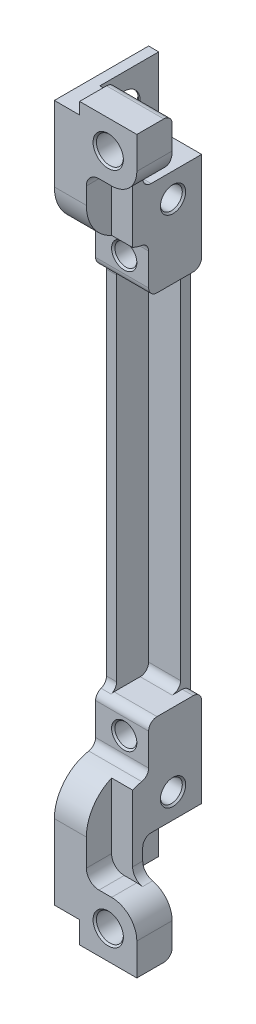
ISO-10303-21;
HEADER;
FILE_DESCRIPTION(('STEP AP214'),'2;1');
FILE_NAME('part.step','',(''),(''),'','','');
FILE_SCHEMA(('AUTOMOTIVE_DESIGN { 1 0 10303 214 1 1 1 1 }'));
ENDSEC;
DATA;
#1=APPLICATION_CONTEXT('core data for automotive mechanical design processes');
#2=APPLICATION_PROTOCOL_DEFINITION('international standard','automotive_design',2000,#1);
#3=PRODUCT_CONTEXT('',#1,'mechanical');
#4=PRODUCT('Part','Part','',(#3));
#5=PRODUCT_RELATED_PRODUCT_CATEGORY('part','',(#4));
#6=PRODUCT_DEFINITION_FORMATION('','',#4);
#7=PRODUCT_DEFINITION_CONTEXT('part definition',#1,'design');
#8=PRODUCT_DEFINITION('design','',#6,#7);
#9=PRODUCT_DEFINITION_SHAPE('','',#8);
#10=(LENGTH_UNIT() NAMED_UNIT(*) SI_UNIT(.MILLI.,.METRE.));
#11=(NAMED_UNIT(*) PLANE_ANGLE_UNIT() SI_UNIT($,.RADIAN.));
#12=(NAMED_UNIT(*) SI_UNIT($,.STERADIAN.) SOLID_ANGLE_UNIT());
#13=UNCERTAINTY_MEASURE_WITH_UNIT(LENGTH_MEASURE(1.E-05),#10,'distance_accuracy_value','');
#14=(GEOMETRIC_REPRESENTATION_CONTEXT(3) GLOBAL_UNCERTAINTY_ASSIGNED_CONTEXT((#13)) GLOBAL_UNIT_ASSIGNED_CONTEXT((#10,
#11,#12)) REPRESENTATION_CONTEXT('',''));
#15=CARTESIAN_POINT('',(0.,0.,0.));
#16=DIRECTION('',(0.,0.,1.));
#17=DIRECTION('',(1.,0.,0.));
#18=AXIS2_PLACEMENT_3D('',#15,#16,#17);
#19=CARTESIAN_POINT('',(6.442821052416,20.6,2.2));
#20=DIRECTION('',(-1.,0.,0.));
#21=DIRECTION('',(0.,0.,1.));
#22=AXIS2_PLACEMENT_3D('',#19,#20,#21);
#23=CYLINDRICAL_SURFACE('',#22,1.);
#24=DIRECTION('',(1.,0.,0.));
#25=VECTOR('',#24,1.);
#26=CARTESIAN_POINT('',(0.,19.6,2.2));
#27=LINE('',#26,#25);
#28=CARTESIAN_POINT('',(5.,19.6,2.2));
#29=VERTEX_POINT('',#28);
#30=CARTESIAN_POINT('',(1.2,19.6,2.2));
#31=VERTEX_POINT('',#30);
#32=EDGE_CURVE('E255',#29,#31,#27,.F.);
#33=ORIENTED_EDGE('',*,*,#32,.F.);
#34=CARTESIAN_POINT('',(5.,20.6,2.2));
#35=DIRECTION('',(-1.,0.,0.));
#36=DIRECTION('',(0.,0.,1.));
#37=AXIS2_PLACEMENT_3D('',#34,#35,#36);
#38=CIRCLE('',#37,1.);
#39=CARTESIAN_POINT('',(5.,20.6,1.2));
#40=VERTEX_POINT('',#39);
#41=EDGE_CURVE('E20',#40,#29,#38,.T.);
#42=ORIENTED_EDGE('',*,*,#41,.F.);
#43=DIRECTION('',(1.,0.,0.));
#44=VECTOR('',#43,1.);
#45=CARTESIAN_POINT('',(5.,20.6,1.2));
#46=LINE('',#45,#44);
#47=CARTESIAN_POINT('',(1.2,20.6,1.2));
#48=VERTEX_POINT('',#47);
#49=EDGE_CURVE('E258',#48,#40,#46,.T.);
#50=ORIENTED_EDGE('',*,*,#49,.F.);
#51=CARTESIAN_POINT('',(1.2,20.6,2.2));
#52=DIRECTION('',(-1.,0.,0.));
#53=DIRECTION('',(0.,0.,1.));
#54=AXIS2_PLACEMENT_3D('',#51,#52,#53);
#55=CIRCLE('',#54,1.);
#56=EDGE_CURVE('E253',#31,#48,#55,.F.);
#57=ORIENTED_EDGE('',*,*,#56,.F.);
#58=EDGE_LOOP('',(#33,#42,#50,#57));
#59=FACE_BOUND('',#58,.T.);
#60=ADVANCED_FACE('F17',(#59),#23,.F.);
#61=CARTESIAN_POINT('',(-0.237352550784,62.2,2.2));
#62=DIRECTION('',(1.,0.,0.));
#63=DIRECTION('',(0.,0.,-1.));
#64=AXIS2_PLACEMENT_3D('',#61,#62,#63);
#65=CYLINDRICAL_SURFACE('',#64,1.);
#66=CARTESIAN_POINT('',(5.,62.2,2.2));
#67=DIRECTION('',(1.,0.,0.));
#68=DIRECTION('',(0.,0.,-1.));
#69=AXIS2_PLACEMENT_3D('',#66,#67,#68);
#70=CIRCLE('',#69,1.);
#71=CARTESIAN_POINT('',(5.,63.2,2.2));
#72=VERTEX_POINT('',#71);
#73=CARTESIAN_POINT('',(5.,62.2,1.2));
#74=VERTEX_POINT('',#73);
#75=EDGE_CURVE('E468',#72,#74,#70,.F.);
#76=ORIENTED_EDGE('',*,*,#75,.F.);
#77=DIRECTION('',(1.,0.,0.));
#78=VECTOR('',#77,1.);
#79=CARTESIAN_POINT('',(0.,63.2,2.2));
#80=LINE('',#79,#78);
#81=CARTESIAN_POINT('',(1.2,63.2,2.2));
#82=VERTEX_POINT('',#81);
#83=EDGE_CURVE('E409',#82,#72,#80,.T.);
#84=ORIENTED_EDGE('',*,*,#83,.F.);
#85=CARTESIAN_POINT('',(1.2,62.2,2.2));
#86=DIRECTION('',(1.,0.,0.));
#87=DIRECTION('',(0.,0.,-1.));
#88=AXIS2_PLACEMENT_3D('',#85,#86,#87);
#89=CIRCLE('',#88,1.);
#90=CARTESIAN_POINT('',(1.2,62.2,1.2));
#91=VERTEX_POINT('',#90);
#92=EDGE_CURVE('E1429',#91,#82,#89,.T.);
#93=ORIENTED_EDGE('',*,*,#92,.F.);
#94=DIRECTION('',(1.,0.,0.));
#95=VECTOR('',#94,1.);
#96=CARTESIAN_POINT('',(5.,62.2,1.2));
#97=LINE('',#96,#95);
#98=EDGE_CURVE('E412',#74,#91,#97,.F.);
#99=ORIENTED_EDGE('',*,*,#98,.F.);
#100=EDGE_LOOP('',(#76,#84,#93,#99));
#101=FACE_BOUND('',#100,.T.);
#102=ADVANCED_FACE('F1421',(#101),#65,.F.);
#103=CARTESIAN_POINT('',(2.769192,83.2,8.));
#104=DIRECTION('',(1.,0.,0.));
#105=DIRECTION('',(0.,0.,-1.));
#106=AXIS2_PLACEMENT_3D('',#103,#104,#105);
#107=CYLINDRICAL_SURFACE('',#106,1.);
#108=DIRECTION('',(1.,0.,0.));
#109=VECTOR('',#108,1.);
#110=CARTESIAN_POINT('',(2.769192,83.2,7.));
#111=LINE('',#110,#109);
#112=CARTESIAN_POINT('',(4.13496649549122,83.2000000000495,7.));
#113=VERTEX_POINT('',#112);
#114=CARTESIAN_POINT('',(3.,83.2,7.));
#115=VERTEX_POINT('',#114);
#116=EDGE_CURVE('E464',#113,#115,#111,.F.);
#117=ORIENTED_EDGE('',*,*,#116,.T.);
#118=CARTESIAN_POINT('',(3.,83.2,8.));
#119=DIRECTION('',(1.,0.,0.));
#120=DIRECTION('',(0.,0.,-1.));
#121=AXIS2_PLACEMENT_3D('',#118,#119,#120);
#122=CIRCLE('',#121,1.);
#123=CARTESIAN_POINT('',(3.,84.2,8.));
#124=VERTEX_POINT('',#123);
#125=EDGE_CURVE('E463',#115,#124,#122,.T.);
#126=ORIENTED_EDGE('',*,*,#125,.T.);
#127=DIRECTION('',(1.,0.,0.));
#128=VECTOR('',#127,1.);
#129=CARTESIAN_POINT('',(0.,84.2,8.));
#130=LINE('',#129,#128);
#131=CARTESIAN_POINT('',(9.8,84.2,8.));
#132=VERTEX_POINT('',#131);
#133=EDGE_CURVE('E362',#132,#124,#130,.F.);
#134=ORIENTED_EDGE('',*,*,#133,.F.);
#135=CARTESIAN_POINT('',(9.8,83.2,8.));
#136=DIRECTION('',(1.,0.,0.));
#137=DIRECTION('',(0.,0.,-1.));
#138=AXIS2_PLACEMENT_3D('',#135,#136,#137);
#139=CIRCLE('',#138,1.);
#140=CARTESIAN_POINT('',(9.8,83.2,7.));
#141=VERTEX_POINT('',#140);
#142=EDGE_CURVE('E376',#132,#141,#139,.F.);
#143=ORIENTED_EDGE('',*,*,#142,.T.);
#144=DIRECTION('',(1.,0.,0.));
#145=VECTOR('',#144,1.);
#146=CARTESIAN_POINT('',(2.769192,83.2,7.));
#147=LINE('',#146,#145);
#148=CARTESIAN_POINT('',(8.66503350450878,83.2000000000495,7.));
#149=VERTEX_POINT('',#148);
#150=EDGE_CURVE('E467',#141,#149,#147,.F.);
#151=ORIENTED_EDGE('',*,*,#150,.T.);
#152=CARTESIAN_POINT('',(8.66503350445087,83.2000000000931,6.99999999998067));
#153=CARTESIAN_POINT('',(8.63382971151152,83.2294086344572,7.00003237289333));
#154=CARTESIAN_POINT('',(8.60126640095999,83.2572500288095,7.00129647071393));
#155=CARTESIAN_POINT('',(8.5341100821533,83.3100017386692,7.00570911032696));
#156=CARTESIAN_POINT('',(8.49952348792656,83.3349206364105,7.00885196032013));
#157=CARTESIAN_POINT('',(8.42919090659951,83.3819530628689,7.01640977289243));
#158=CARTESIAN_POINT('',(8.39346117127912,83.4040936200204,7.02081084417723));
#159=CARTESIAN_POINT('',(8.32079675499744,83.4461481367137,7.0305274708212));
#160=CARTESIAN_POINT('',(8.28386091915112,83.4660598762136,7.03584392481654));
#161=CARTESIAN_POINT('',(8.17356218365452,83.521806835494,7.05241059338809));
#162=CARTESIAN_POINT('',(8.09889644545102,83.5548196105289,7.06450369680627));
#163=CARTESIAN_POINT('',(7.94719211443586,83.6144665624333,7.08936554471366));
#164=CARTESIAN_POINT('',(7.87015233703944,83.6410974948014,7.10213462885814));
#165=CARTESIAN_POINT('',(7.71369549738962,83.6890959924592,7.12734563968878));
#166=CARTESIAN_POINT('',(7.63426405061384,83.7104182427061,7.13978399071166));
#167=CARTESIAN_POINT('',(7.47405737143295,83.7482019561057,7.16335912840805));
#168=CARTESIAN_POINT('',(7.39328179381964,83.7646621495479,7.17449557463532));
#169=CARTESIAN_POINT('',(7.19313916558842,83.7998282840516,7.19945615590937));
#170=CARTESIAN_POINT('',(7.07318674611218,83.816057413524,7.21214439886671));
#171=CARTESIAN_POINT('',(6.83195409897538,83.8402341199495,7.23166423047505));
#172=CARTESIAN_POINT('',(6.7106734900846,83.8481792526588,7.23849409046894));
#173=CARTESIAN_POINT('',(6.46770712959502,83.8562659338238,7.24545091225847));
#174=CARTESIAN_POINT('',(6.34602156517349,83.8564106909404,7.24558063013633));
#175=CARTESIAN_POINT('',(6.10309056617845,83.8489161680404,7.23912342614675));
#176=CARTESIAN_POINT('',(5.98184504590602,83.8412784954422,7.23253789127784));
#177=CARTESIAN_POINT('',(5.76293912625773,83.8199206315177,7.21524203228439));
#178=CARTESIAN_POINT('',(5.6650615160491,83.8075856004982,7.20551907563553));
#179=CARTESIAN_POINT('',(5.4706163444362,83.7769127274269,7.18297116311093));
#180=CARTESIAN_POINT('',(5.37404859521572,83.7585757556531,7.17014665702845));
#181=CARTESIAN_POINT('',(5.1834679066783,83.7152823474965,7.14259852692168));
#182=CARTESIAN_POINT('',(5.0894410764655,83.6903776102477,7.12789017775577));
#183=CARTESIAN_POINT('',(4.90384688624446,83.6327604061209,7.09790120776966));
#184=CARTESIAN_POINT('',(4.81227926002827,83.6000487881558,7.08262064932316));
#185=CARTESIAN_POINT('',(4.66982297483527,83.5406004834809,7.05949853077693));
#186=CARTESIAN_POINT('',(4.61772093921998,83.5169567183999,7.05118637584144));
#187=CARTESIAN_POINT('',(4.51528090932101,83.4659698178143,7.03564958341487));
#188=CARTESIAN_POINT('',(4.46494014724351,83.4386328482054,7.02842317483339));
#189=CARTESIAN_POINT('',(4.36591073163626,83.3792722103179,7.0157252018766));
#190=CARTESIAN_POINT('',(4.31725150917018,83.3471929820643,7.0102773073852));
#191=CARTESIAN_POINT('',(4.24676325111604,83.2951705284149,7.0043856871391));
#192=CARTESIAN_POINT('',(4.22362724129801,83.2771272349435,7.00280072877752));
#193=CARTESIAN_POINT('',(4.17842824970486,83.2396370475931,7.0006106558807));
#194=CARTESIAN_POINT('',(4.1563666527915,83.2201884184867,7.00000677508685));
#195=CARTESIAN_POINT('',(4.13496649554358,83.2000000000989,7.));
#196=B_SPLINE_CURVE_WITH_KNOTS('',3,(#152,#153,#154,#155,#156,#157,#158,#159,#160,#161,#162,
#163,#164,#165,#166,#167,#168,#169,#170,#171,#172,#173,#174,#175,#176,#177,#178,#179,#180,#181,
#182,#183,#184,#185,#186,#187,#188,#189,#190,#191,#192,#193,#194,#195),.UNSPECIFIED.,.F.,.F.,(4,
2,2,2,2,2,2,2,2,2,2,2,2,2,2,2,2,2,2,2,2,4),(0.,0.128445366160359,0.256503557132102,
0.383199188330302,0.510019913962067,0.757201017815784,1.00450752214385,1.25385776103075,
1.50327305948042,1.86793779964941,2.23271010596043,2.59733236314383,2.96187932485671,
3.25904669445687,3.55617099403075,3.85102284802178,4.14584265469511,4.31916870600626,
4.49220888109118,4.66746610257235,4.7555524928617,4.84374956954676),.UNSPECIFIED.);
#197=EDGE_CURVE('E457',#149,#113,#196,.T.);
#198=ORIENTED_EDGE('',*,*,#197,.T.);
#199=EDGE_LOOP('',(#117,#126,#134,#143,#151,#198));
#200=FACE_BOUND('',#199,.T.);
#201=ADVANCED_FACE('F1361',(#200),#107,.T.);
#202=CARTESIAN_POINT('',(9.8,77.4,7.));
#203=DIRECTION('',(0.,1.,0.));
#204=DIRECTION('',(0.,0.,1.));
#205=AXIS2_PLACEMENT_3D('',#202,#203,#204);
#206=PLANE('',#205);
#207=DIRECTION('',(0.,0.,-1.));
#208=VECTOR('',#207,1.);
#209=CARTESIAN_POINT('',(6.8,77.4,11.35648));
#210=LINE('',#209,#208);
#211=CARTESIAN_POINT('',(6.8,77.4,11.2));
#212=VERTEX_POINT('',#211);
#213=CARTESIAN_POINT('',(6.8,77.4,8.2));
#214=VERTEX_POINT('',#213);
#215=EDGE_CURVE('E377',#212,#214,#210,.T.);
#216=ORIENTED_EDGE('',*,*,#215,.F.);
#217=DIRECTION('',(1.,0.,0.));
#218=VECTOR('',#217,1.);
#219=CARTESIAN_POINT('',(9.8,77.4,11.2));
#220=LINE('',#219,#218);
#221=CARTESIAN_POINT('',(5.3,77.4,11.2));
#222=VERTEX_POINT('',#221);
#223=EDGE_CURVE('E460',#222,#212,#220,.T.);
#224=ORIENTED_EDGE('',*,*,#223,.F.);
#225=DIRECTION('',(0.,0.,-1.));
#226=VECTOR('',#225,1.);
#227=CARTESIAN_POINT('',(5.3,77.4,11.35648));
#228=LINE('',#227,#226);
#229=CARTESIAN_POINT('',(5.3,77.4,8.2));
#230=VERTEX_POINT('',#229);
#231=EDGE_CURVE('E358',#222,#230,#228,.T.);
#232=ORIENTED_EDGE('',*,*,#231,.T.);
#233=DIRECTION('',(-1.,0.,0.));
#234=VECTOR('',#233,1.);
#235=CARTESIAN_POINT('',(6.3,77.4,8.2));
#236=LINE('',#235,#234);
#237=EDGE_CURVE('E382',#230,#214,#236,.F.);
#238=ORIENTED_EDGE('',*,*,#237,.T.);
#239=EDGE_LOOP('',(#216,#224,#232,#238));
#240=FACE_BOUND('',#239,.T.);
#241=ADVANCED_FACE('F1351',(#240),#206,.F.);
#242=CARTESIAN_POINT('',(6.4,80.8,12.2));
#243=DIRECTION('',(0.,0.,1.));
#244=DIRECTION('',(1.,0.,0.));
#245=AXIS2_PLACEMENT_3D('',#242,#243,#244);
#246=CYLINDRICAL_SURFACE('',#245,1.6);
#247=CARTESIAN_POINT('',(6.4,80.8,8.70002767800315));
#248=DIRECTION('',(0.,0.,-1.));
#249=DIRECTION('',(0.,-1.,0.));
#250=AXIS2_PLACEMENT_3D('',#247,#248,#249);
#251=CIRCLE('',#250,1.60000000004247);
#252=CARTESIAN_POINT('',(6.4,79.1999999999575,8.70002767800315));
#253=VERTEX_POINT('',#252);
#254=EDGE_CURVE('E453',#253,#253,#251,.T.);
#255=ORIENTED_EDGE('',*,*,#254,.T.);
#256=EDGE_LOOP('',(#255));
#257=FACE_BOUND('',#256,.T.);
#258=CARTESIAN_POINT('',(6.4,80.8,11.0001295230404));
#259=DIRECTION('',(0.,0.,1.));
#260=DIRECTION('',(0.,-1.,0.));
#261=AXIS2_PLACEMENT_3D('',#258,#259,#260);
#262=CIRCLE('',#261,1.60000000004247);
#263=CARTESIAN_POINT('',(6.4,79.1999999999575,11.0001295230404));
#264=VERTEX_POINT('',#263);
#265=EDGE_CURVE('E349',#264,#264,#262,.T.);
#266=ORIENTED_EDGE('',*,*,#265,.T.);
#267=EDGE_LOOP('',(#266));
#268=FACE_BOUND('',#267,.T.);
#269=ADVANCED_FACE('F1408',(#257,#268),#246,.F.);
#270=CARTESIAN_POINT('',(6.4,80.8,7.00000000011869));
#271=DIRECTION('',(0.,0.,-1.));
#272=DIRECTION('',(-1.,0.,0.));
#273=AXIS2_PLACEMENT_3D('',#270,#271,#272);
#274=CONICAL_SURFACE('',#273,3.30005708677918,0.785406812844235);
#275=ORIENTED_EDGE('',*,*,#254,.F.);
#276=EDGE_LOOP('',(#275));
#277=FACE_BOUND('',#276,.T.);
#278=ORIENTED_EDGE('',*,*,#197,.F.);
#279=CARTESIAN_POINT('',(6.4,80.8,7.00000000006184));
#280=DIRECTION('',(0.,0.,-1.));
#281=DIRECTION('',(-1.,0.,0.));
#282=AXIS2_PLACEMENT_3D('',#279,#280,#281);
#283=CIRCLE('',#282,3.30005708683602);
#284=EDGE_CURVE('E348',#113,#149,#283,.F.);
#285=ORIENTED_EDGE('',*,*,#284,.F.);
#286=EDGE_LOOP('',(#278,#285));
#287=FACE_BOUND('',#286,.T.);
#288=ADVANCED_FACE('F1366',(#277,#287),#274,.F.);
#289=CARTESIAN_POINT('',(7.8,76.0125178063,11.35710394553));
#290=DIRECTION('',(0.,0.,-1.));
#291=DIRECTION('',(-1.,0.,0.));
#292=AXIS2_PLACEMENT_3D('',#289,#290,#291);
#293=CYLINDRICAL_SURFACE('',#292,1.5);
#294=DIRECTION('',(0.,0.,-1.));
#295=VECTOR('',#294,1.);
#296=CARTESIAN_POINT('',(7.46666666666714,77.4750118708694,11.35648));
#297=LINE('',#296,#295);
#298=CARTESIAN_POINT('',(7.46666666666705,77.4750118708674,8.2));
#299=VERTEX_POINT('',#298);
#300=CARTESIAN_POINT('',(7.46666666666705,77.4750118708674,7.));
#301=VERTEX_POINT('',#300);
#302=EDGE_CURVE('E381',#299,#301,#297,.T.);
#303=ORIENTED_EDGE('',*,*,#302,.F.);
#304=CARTESIAN_POINT('',(7.8,76.0125178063,8.2));
#305=DIRECTION('',(0.,0.,-1.));
#306=DIRECTION('',(-1.,0.,0.));
#307=AXIS2_PLACEMENT_3D('',#304,#305,#306);
#308=CIRCLE('',#307,1.5);
#309=CARTESIAN_POINT('',(6.3,76.0125178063,8.2));
#310=VERTEX_POINT('',#309);
#311=EDGE_CURVE('E384',#299,#310,#308,.F.);
#312=ORIENTED_EDGE('',*,*,#311,.T.);
#313=DIRECTION('',(0.,0.,-1.));
#314=VECTOR('',#313,1.);
#315=CARTESIAN_POINT('',(6.3,76.0125178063,11.35710394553));
#316=LINE('',#315,#314);
#317=CARTESIAN_POINT('',(6.3,76.0125178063,7.));
#318=VERTEX_POINT('',#317);
#319=EDGE_CURVE('E450',#318,#310,#316,.F.);
#320=ORIENTED_EDGE('',*,*,#319,.F.);
#321=CARTESIAN_POINT('',(7.8,76.0125178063,7.));
#322=DIRECTION('',(0.,0.,-1.));
#323=DIRECTION('',(-1.,0.,0.));
#324=AXIS2_PLACEMENT_3D('',#321,#322,#323);
#325=CIRCLE('',#324,1.5);
#326=EDGE_CURVE('E392',#301,#318,#325,.F.);
#327=ORIENTED_EDGE('',*,*,#326,.F.);
#328=EDGE_LOOP('',(#303,#312,#320,#327));
#329=FACE_BOUND('',#328,.T.);
#330=ADVANCED_FACE('F1401',(#329),#293,.F.);
#331=CARTESIAN_POINT('',(1.2,75.8,6.));
#332=DIRECTION('',(1.,0.,0.));
#333=DIRECTION('',(0.,0.,-1.));
#334=AXIS2_PLACEMENT_3D('',#331,#332,#333);
#335=CYLINDRICAL_SURFACE('',#334,1.);
#336=DIRECTION('',(1.,0.,0.));
#337=VECTOR('',#336,1.);
#338=CARTESIAN_POINT('',(1.2,74.8,6.));
#339=LINE('',#338,#337);
#340=CARTESIAN_POINT('',(6.3,74.8,6.));
#341=VERTEX_POINT('',#340);
#342=CARTESIAN_POINT('',(1.2,74.8,6.));
#343=VERTEX_POINT('',#342);
#344=EDGE_CURVE('E295',#341,#343,#339,.F.);
#345=ORIENTED_EDGE('',*,*,#344,.T.);
#346=CARTESIAN_POINT('',(1.2,75.8,6.));
#347=DIRECTION('',(1.,0.,0.));
#348=DIRECTION('',(0.,0.,-1.));
#349=AXIS2_PLACEMENT_3D('',#346,#347,#348);
#350=CIRCLE('',#349,1.);
#351=CARTESIAN_POINT('',(1.2,75.8,7.));
#352=VERTEX_POINT('',#351);
#353=EDGE_CURVE('E306',#352,#343,#350,.T.);
#354=ORIENTED_EDGE('',*,*,#353,.F.);
#355=DIRECTION('',(-1.,0.,0.));
#356=VECTOR('',#355,1.);
#357=CARTESIAN_POINT('',(0.,75.8,7.));
#358=LINE('',#357,#356);
#359=CARTESIAN_POINT('',(6.3,75.8,7.));
#360=VERTEX_POINT('',#359);
#361=EDGE_CURVE('E337',#360,#352,#358,.T.);
#362=ORIENTED_EDGE('',*,*,#361,.F.);
#363=CARTESIAN_POINT('',(6.3,75.8,6.));
#364=DIRECTION('',(1.,0.,0.));
#365=DIRECTION('',(0.,0.,-1.));
#366=AXIS2_PLACEMENT_3D('',#363,#364,#365);
#367=CIRCLE('',#366,1.);
#368=EDGE_CURVE('E452',#341,#360,#367,.F.);
#369=ORIENTED_EDGE('',*,*,#368,.F.);
#370=EDGE_LOOP('',(#345,#354,#362,#369));
#371=FACE_BOUND('',#370,.T.);
#372=ADVANCED_FACE('F672',(#371),#335,.F.);
#373=CARTESIAN_POINT('',(6.4,0.8,7.00000000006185));
#374=DIRECTION('',(0.,0.,-1.));
#375=DIRECTION('',(-1.,0.,0.));
#376=AXIS2_PLACEMENT_3D('',#373,#374,#375);
#377=CONICAL_SURFACE('',#376,3.30005708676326,0.785406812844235);
#378=CARTESIAN_POINT('',(6.4,0.8,8.70002767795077));
#379=DIRECTION('',(0.,0.,1.));
#380=DIRECTION('',(1.,0.,0.));
#381=AXIS2_PLACEMENT_3D('',#378,#379,#380);
#382=CIRCLE('',#381,1.6);
#383=CARTESIAN_POINT('',(8.,0.8,8.70002767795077));
#384=VERTEX_POINT('',#383);
#385=EDGE_CURVE('E432',#384,#384,#382,.T.);
#386=ORIENTED_EDGE('',*,*,#385,.T.);
#387=EDGE_LOOP('',(#386));
#388=FACE_BOUND('',#387,.T.);
#389=CARTESIAN_POINT('',(4.13496649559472,-1.6000000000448,6.99999999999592));
#390=CARTESIAN_POINT('',(4.16617028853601,-1.62940863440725,7.00003237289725));
#391=CARTESIAN_POINT('',(4.19873359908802,-1.65725002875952,7.00129647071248));
#392=CARTESIAN_POINT('',(4.26588991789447,-1.71000173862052,7.00570911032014));
#393=CARTESIAN_POINT('',(4.3004765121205,-1.73492063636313,7.0088519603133));
#394=CARTESIAN_POINT('',(4.37080909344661,-1.78195306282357,7.01640977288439));
#395=CARTESIAN_POINT('',(4.4065388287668,-1.80409361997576,7.020810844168));
#396=CARTESIAN_POINT('',(4.47920324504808,-1.84614813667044,7.03052747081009));
#397=CARTESIAN_POINT('',(4.51613908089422,-1.86605987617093,7.03584392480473));
#398=CARTESIAN_POINT('',(4.62643781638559,-1.92180683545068,7.05241059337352));
#399=CARTESIAN_POINT('',(4.70110355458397,-1.95481961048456,7.06450369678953));
#400=CARTESIAN_POINT('',(4.85280788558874,-2.01446656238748,7.08936554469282));
#401=CARTESIAN_POINT('',(4.92984766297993,-2.04109749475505,7.10213462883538));
#402=CARTESIAN_POINT('',(5.08630450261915,-2.08909599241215,7.12734563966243));
#403=CARTESIAN_POINT('',(5.16573594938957,-2.11041824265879,7.13978399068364));
#404=CARTESIAN_POINT('',(5.32594262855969,-2.14820195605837,7.16335912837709));
#405=CARTESIAN_POINT('',(5.4067182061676,-2.16466214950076,7.17449557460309));
#406=CARTESIAN_POINT('',(5.60686083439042,-2.19982828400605,7.19945615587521));
#407=CARTESIAN_POINT('',(5.72681325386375,-2.21605741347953,7.21214439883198));
#408=CARTESIAN_POINT('',(5.96804590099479,-2.24023411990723,7.23166423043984));
#409=CARTESIAN_POINT('',(6.08932650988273,-2.24817925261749,7.23849409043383));
#410=CARTESIAN_POINT('',(6.33229287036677,-2.25626593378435,7.24545091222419));
#411=CARTESIAN_POINT('',(6.45397843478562,-2.2564106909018,7.24558063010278));
#412=CARTESIAN_POINT('',(6.69690943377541,-2.24891616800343,7.23912342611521));
#413=CARTESIAN_POINT('',(6.81815495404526,-2.24127849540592,7.23253789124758));
#414=CARTESIAN_POINT('',(7.03706087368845,-2.21992063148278,7.21524203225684));
#415=CARTESIAN_POINT('',(7.13493848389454,-2.20758560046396,7.20551907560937));
#416=CARTESIAN_POINT('',(7.32938365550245,-2.17691272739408,7.18297116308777));
#417=CARTESIAN_POINT('',(7.42595140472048,-2.15857575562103,7.1701466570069));
#418=CARTESIAN_POINT('',(7.61653209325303,-2.11528234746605,7.14259852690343));
#419=CARTESIAN_POINT('',(7.71055892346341,-2.09037761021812,7.12789017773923));
#420=CARTESIAN_POINT('',(7.89615311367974,-2.03276040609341,7.09790120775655));
#421=CARTESIAN_POINT('',(7.98772073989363,-2.00004878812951,7.08262064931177));
#422=CARTESIAN_POINT('',(8.1301770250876,-1.94060048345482,7.05949853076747));
#423=CARTESIAN_POINT('',(8.18227906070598,-1.91695671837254,7.05118637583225));
#424=CARTESIAN_POINT('',(8.28471909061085,-1.86596981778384,7.03564958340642));
#425=CARTESIAN_POINT('',(8.33505985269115,-1.83863284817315,7.02842317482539));
#426=CARTESIAN_POINT('',(8.43408926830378,-1.77927221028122,7.01572520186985));
#427=CARTESIAN_POINT('',(8.48274849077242,-1.74719298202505,7.01027730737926));
#428=CARTESIAN_POINT('',(8.55323674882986,-1.69517052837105,7.00438568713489));
#429=CARTESIAN_POINT('',(8.5763727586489,-1.67712723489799,7.00280072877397));
#430=CARTESIAN_POINT('',(8.62157175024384,-1.63963704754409,7.00061065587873));
#431=CARTESIAN_POINT('',(8.64363334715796,-1.62018841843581,7.00000677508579));
#432=CARTESIAN_POINT('',(8.66503350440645,-1.60000000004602,7.));
#433=B_SPLINE_CURVE_WITH_KNOTS('',3,(#389,#390,#391,#392,#393,#394,#395,#396,#397,#398,#399,
#400,#401,#402,#403,#404,#405,#406,#407,#408,#409,#410,#411,#412,#413,#414,#415,#416,#417,#418,
#419,#420,#421,#422,#423,#424,#425,#426,#427,#428,#429,#430,#431,#432),.UNSPECIFIED.,.F.,.F.,(4,
2,2,2,2,2,2,2,2,2,2,2,2,2,2,2,2,2,2,2,2,4),(0.,0.128445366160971,0.25650355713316,
0.383199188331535,0.510019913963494,0.757201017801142,1.00450752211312,1.25385776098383,
1.50327305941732,1.86793779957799,2.23271010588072,2.5973323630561,2.96187932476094,
3.25904669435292,3.55617099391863,3.85102284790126,4.14584265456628,4.31916870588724,
4.49220888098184,4.66746610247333,4.75555249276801,4.84374956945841),.UNSPECIFIED.);
#434=CARTESIAN_POINT('',(4.13496649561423,-1.60000000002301,7.00000000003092));
#435=VERTEX_POINT('',#434);
#436=CARTESIAN_POINT('',(8.66503350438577,-1.60000000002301,7.00000000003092));
#437=VERTEX_POINT('',#436);
#438=EDGE_CURVE('E645',#435,#437,#433,.T.);
#439=ORIENTED_EDGE('',*,*,#438,.F.);
#440=CARTESIAN_POINT('',(6.4,0.8,7.00000000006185));
#441=DIRECTION('',(0.,0.,-1.));
#442=DIRECTION('',(-1.,0.,0.));
#443=AXIS2_PLACEMENT_3D('',#440,#441,#442);
#444=CIRCLE('',#443,3.30005708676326);
#445=EDGE_CURVE('E615',#437,#435,#444,.F.);
#446=ORIENTED_EDGE('',*,*,#445,.F.);
#447=EDGE_LOOP('',(#439,#446));
#448=FACE_BOUND('',#447,.T.);
#449=ADVANCED_FACE('F654',(#388,#448),#377,.F.);
#450=CARTESIAN_POINT('',(1.2,7.,6.));
#451=DIRECTION('',(1.,0.,0.));
#452=DIRECTION('',(0.,0.,-1.));
#453=AXIS2_PLACEMENT_3D('',#450,#451,#452);
#454=CYLINDRICAL_SURFACE('',#453,1.);
#455=DIRECTION('',(-1.,0.,0.));
#456=VECTOR('',#455,1.);
#457=CARTESIAN_POINT('',(0.,7.,7.));
#458=LINE('',#457,#456);
#459=CARTESIAN_POINT('',(1.2,7.,7.));
#460=VERTEX_POINT('',#459);
#461=CARTESIAN_POINT('',(6.3,7.,7.));
#462=VERTEX_POINT('',#461);
#463=EDGE_CURVE('E421',#460,#462,#458,.F.);
#464=ORIENTED_EDGE('',*,*,#463,.F.);
#465=CARTESIAN_POINT('',(1.2,7.,6.));
#466=DIRECTION('',(1.,0.,0.));
#467=DIRECTION('',(0.,0.,-1.));
#468=AXIS2_PLACEMENT_3D('',#465,#466,#467);
#469=CIRCLE('',#468,1.);
#470=CARTESIAN_POINT('',(1.2,8.,6.));
#471=VERTEX_POINT('',#470);
#472=EDGE_CURVE('E623',#471,#460,#469,.T.);
#473=ORIENTED_EDGE('',*,*,#472,.F.);
#474=DIRECTION('',(1.,0.,0.));
#475=VECTOR('',#474,1.);
#476=CARTESIAN_POINT('',(1.2,8.,6.));
#477=LINE('',#476,#475);
#478=CARTESIAN_POINT('',(6.3,8.,6.));
#479=VERTEX_POINT('',#478);
#480=EDGE_CURVE('E416',#471,#479,#477,.T.);
#481=ORIENTED_EDGE('',*,*,#480,.T.);
#482=CARTESIAN_POINT('',(6.3,7.,6.));
#483=DIRECTION('',(1.,0.,0.));
#484=DIRECTION('',(0.,0.,-1.));
#485=AXIS2_PLACEMENT_3D('',#482,#483,#484);
#486=CIRCLE('',#485,1.);
#487=EDGE_CURVE('E652',#462,#479,#486,.F.);
#488=ORIENTED_EDGE('',*,*,#487,.F.);
#489=EDGE_LOOP('',(#464,#473,#481,#488));
#490=FACE_BOUND('',#489,.T.);
#491=ADVANCED_FACE('F663',(#490),#454,.F.);
#492=CARTESIAN_POINT('',(2.84352,-1.6,8.));
#493=DIRECTION('',(1.,0.,0.));
#494=DIRECTION('',(0.,0.,-1.));
#495=AXIS2_PLACEMENT_3D('',#492,#493,#494);
#496=CYLINDRICAL_SURFACE('',#495,1.);
#497=DIRECTION('',(-1.,0.,0.));
#498=VECTOR('',#497,1.);
#499=CARTESIAN_POINT('',(0.,-1.6,7.));
#500=LINE('',#499,#498);
#501=CARTESIAN_POINT('',(9.8,-1.6,7.));
#502=VERTEX_POINT('',#501);
#503=EDGE_CURVE('E619',#502,#437,#500,.T.);
#504=ORIENTED_EDGE('',*,*,#503,.F.);
#505=CARTESIAN_POINT('',(9.8,-1.6,8.));
#506=DIRECTION('',(1.,0.,0.));
#507=DIRECTION('',(0.,0.,-1.));
#508=AXIS2_PLACEMENT_3D('',#505,#506,#507);
#509=CIRCLE('',#508,1.);
#510=CARTESIAN_POINT('',(9.8,-2.6,8.));
#511=VERTEX_POINT('',#510);
#512=EDGE_CURVE('E442',#502,#511,#509,.F.);
#513=ORIENTED_EDGE('',*,*,#512,.T.);
#514=DIRECTION('',(1.,0.,0.));
#515=VECTOR('',#514,1.);
#516=CARTESIAN_POINT('',(0.,-2.6,8.));
#517=LINE('',#516,#515);
#518=CARTESIAN_POINT('',(3.,-2.6,8.));
#519=VERTEX_POINT('',#518);
#520=EDGE_CURVE('E443',#519,#511,#517,.T.);
#521=ORIENTED_EDGE('',*,*,#520,.F.);
#522=CARTESIAN_POINT('',(3.,-1.6,8.));
#523=DIRECTION('',(1.,0.,0.));
#524=DIRECTION('',(0.,0.,-1.));
#525=AXIS2_PLACEMENT_3D('',#522,#523,#524);
#526=CIRCLE('',#525,1.);
#527=CARTESIAN_POINT('',(3.,-1.6,7.));
#528=VERTEX_POINT('',#527);
#529=EDGE_CURVE('E613',#528,#519,#526,.F.);
#530=ORIENTED_EDGE('',*,*,#529,.F.);
#531=DIRECTION('',(-1.,0.,0.));
#532=VECTOR('',#531,1.);
#533=CARTESIAN_POINT('',(0.,-1.6,7.));
#534=LINE('',#533,#532);
#535=EDGE_CURVE('E618',#435,#528,#534,.T.);
#536=ORIENTED_EDGE('',*,*,#535,.F.);
#537=ORIENTED_EDGE('',*,*,#438,.T.);
#538=EDGE_LOOP('',(#504,#513,#521,#530,#536,#537));
#539=FACE_BOUND('',#538,.T.);
#540=ADVANCED_FACE('F658',(#539),#496,.T.);
#541=CARTESIAN_POINT('',(9.8,4.2,17.6));
#542=DIRECTION('',(0.,-1.,0.));
#543=DIRECTION('',(0.,0.,-1.));
#544=AXIS2_PLACEMENT_3D('',#541,#542,#543);
#545=PLANE('',#544);
#546=DIRECTION('',(0.,0.,1.));
#547=VECTOR('',#546,1.);
#548=CARTESIAN_POINT('',(5.3,4.2,8.049196));
#549=LINE('',#548,#547);
#550=CARTESIAN_POINT('',(5.3,4.2,8.2));
#551=VERTEX_POINT('',#550);
#552=CARTESIAN_POINT('',(5.3,4.2,11.2));
#553=VERTEX_POINT('',#552);
#554=EDGE_CURVE('E611',#551,#553,#549,.T.);
#555=ORIENTED_EDGE('',*,*,#554,.T.);
#556=DIRECTION('',(1.,0.,0.));
#557=VECTOR('',#556,1.);
#558=CARTESIAN_POINT('',(9.8,4.2,11.2));
#559=LINE('',#558,#557);
#560=CARTESIAN_POINT('',(6.8,4.2,11.2));
#561=VERTEX_POINT('',#560);
#562=EDGE_CURVE('E439',#561,#553,#559,.F.);
#563=ORIENTED_EDGE('',*,*,#562,.F.);
#564=DIRECTION('',(0.,0.,1.));
#565=VECTOR('',#564,1.);
#566=CARTESIAN_POINT('',(6.8,4.2,6.849196));
#567=LINE('',#566,#565);
#568=CARTESIAN_POINT('',(6.8,4.2,8.2));
#569=VERTEX_POINT('',#568);
#570=EDGE_CURVE('E429',#569,#561,#567,.T.);
#571=ORIENTED_EDGE('',*,*,#570,.F.);
#572=DIRECTION('',(1.,0.,0.));
#573=VECTOR('',#572,1.);
#574=CARTESIAN_POINT('',(9.8,4.2,8.2));
#575=LINE('',#574,#573);
#576=EDGE_CURVE('E435',#551,#569,#575,.T.);
#577=ORIENTED_EDGE('',*,*,#576,.F.);
#578=EDGE_LOOP('',(#555,#563,#571,#577));
#579=FACE_BOUND('',#578,.T.);
#580=ADVANCED_FACE('F662',(#579),#545,.F.);
#581=CARTESIAN_POINT('',(6.4,0.8,12.2));
#582=DIRECTION('',(0.,0.,1.));
#583=DIRECTION('',(1.,0.,0.));
#584=AXIS2_PLACEMENT_3D('',#581,#582,#583);
#585=CYLINDRICAL_SURFACE('',#584,1.6);
#586=ORIENTED_EDGE('',*,*,#385,.F.);
#587=EDGE_LOOP('',(#586));
#588=FACE_BOUND('',#587,.T.);
#589=CARTESIAN_POINT('',(6.4,0.8,11.0001295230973));
#590=DIRECTION('',(0.,0.,1.));
#591=DIRECTION('',(0.,-1.,0.));
#592=AXIS2_PLACEMENT_3D('',#589,#590,#591);
#593=CIRCLE('',#592,1.59999999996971);
#594=CARTESIAN_POINT('',(6.4,-0.799999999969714,11.0001295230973));
#595=VERTEX_POINT('',#594);
#596=EDGE_CURVE('E944',#595,#595,#593,.T.);
#597=ORIENTED_EDGE('',*,*,#596,.T.);
#598=EDGE_LOOP('',(#597));
#599=FACE_BOUND('',#598,.T.);
#600=ADVANCED_FACE('F932',(#588,#599),#585,.F.);
#601=CARTESIAN_POINT('',(7.8,5.587482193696,6.860051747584));
#602=DIRECTION('',(0.,0.,1.));
#603=DIRECTION('',(1.,0.,0.));
#604=AXIS2_PLACEMENT_3D('',#601,#602,#603);
#605=CYLINDRICAL_SURFACE('',#604,1.5);
#606=DIRECTION('',(0.,0.,1.));
#607=VECTOR('',#606,1.);
#608=CARTESIAN_POINT('',(6.3,5.587482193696,6.860051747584));
#609=LINE('',#608,#607);
#610=CARTESIAN_POINT('',(6.3,5.587482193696,8.2));
#611=VERTEX_POINT('',#610);
#612=CARTESIAN_POINT('',(6.3,5.587482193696,7.));
#613=VERTEX_POINT('',#612);
#614=EDGE_CURVE('E259',#611,#613,#609,.F.);
#615=ORIENTED_EDGE('',*,*,#614,.F.);
#616=CARTESIAN_POINT('',(7.8,5.587482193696,8.2));
#617=DIRECTION('',(0.,0.,1.));
#618=DIRECTION('',(1.,0.,0.));
#619=AXIS2_PLACEMENT_3D('',#616,#617,#618);
#620=CIRCLE('',#619,1.5);
#621=CARTESIAN_POINT('',(7.46666666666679,4.12498812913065,8.2));
#622=VERTEX_POINT('',#621);
#623=EDGE_CURVE('E605',#611,#622,#620,.T.);
#624=ORIENTED_EDGE('',*,*,#623,.T.);
#625=DIRECTION('',(0.,0.,1.));
#626=VECTOR('',#625,1.);
#627=CARTESIAN_POINT('',(7.46666666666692,4.12498812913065,6.849196));
#628=LINE('',#627,#626);
#629=CARTESIAN_POINT('',(7.46666666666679,4.12498812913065,7.));
#630=VERTEX_POINT('',#629);
#631=EDGE_CURVE('E426',#630,#622,#628,.T.);
#632=ORIENTED_EDGE('',*,*,#631,.F.);
#633=CARTESIAN_POINT('',(7.8,5.587482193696,7.));
#634=DIRECTION('',(0.,0.,1.));
#635=DIRECTION('',(1.,0.,0.));
#636=AXIS2_PLACEMENT_3D('',#633,#634,#635);
#637=CIRCLE('',#636,1.5);
#638=EDGE_CURVE('E620',#613,#630,#637,.T.);
#639=ORIENTED_EDGE('',*,*,#638,.F.);
#640=EDGE_LOOP('',(#615,#624,#632,#639));
#641=FACE_BOUND('',#640,.T.);
#642=ADVANCED_FACE('F929',(#641),#605,.F.);
#643=CARTESIAN_POINT('',(3.4,16.7,0.));
#644=DIRECTION('',(0.,0.,-1.));
#645=DIRECTION('',(-1.,0.,0.));
#646=AXIS2_PLACEMENT_3D('',#643,#644,#645);
#647=CYLINDRICAL_SURFACE('',#646,1.3);
#648=CARTESIAN_POINT('',(3.4,16.7,6.10000016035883));
#649=DIRECTION('',(0.,0.,1.));
#650=DIRECTION('',(0.,-1.,0.));
#651=AXIS2_PLACEMENT_3D('',#648,#649,#650);
#652=CIRCLE('',#651,1.29999999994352);
#653=CARTESIAN_POINT('',(3.4,15.4000000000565,6.10000016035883));
#654=VERTEX_POINT('',#653);
#655=EDGE_CURVE('E402',#654,#654,#652,.T.);
#656=ORIENTED_EDGE('',*,*,#655,.T.);
#657=EDGE_LOOP('',(#656));
#658=FACE_BOUND('',#657,.T.);
#659=CARTESIAN_POINT('',(3.4,16.7,1.00016099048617));
#660=DIRECTION('',(0.,0.,-1.));
#661=DIRECTION('',(0.,-1.,0.));
#662=AXIS2_PLACEMENT_3D('',#659,#660,#661);
#663=CIRCLE('',#662,1.30000000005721);
#664=CARTESIAN_POINT('',(3.4,15.3999999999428,1.00016099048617));
#665=VERTEX_POINT('',#664);
#666=EDGE_CURVE('E1010',#665,#665,#663,.T.);
#667=ORIENTED_EDGE('',*,*,#666,.T.);
#668=EDGE_LOOP('',(#667));
#669=FACE_BOUND('',#668,.T.);
#670=ADVANCED_FACE('F926',(#658,#669),#647,.F.);
#671=CARTESIAN_POINT('',(0.,19.6,6.3));
#672=DIRECTION('',(0.,1.,0.));
#673=DIRECTION('',(0.,0.,1.));
#674=AXIS2_PLACEMENT_3D('',#671,#672,#673);
#675=PLANE('',#674);
#676=DIRECTION('',(0.,0.,-1.));
#677=VECTOR('',#676,1.);
#678=CARTESIAN_POINT('',(5.,19.6,0.));
#679=LINE('',#678,#677);
#680=CARTESIAN_POINT('',(5.,19.6,1.));
#681=VERTEX_POINT('',#680);
#682=EDGE_CURVE('E249',#29,#681,#679,.T.);
#683=ORIENTED_EDGE('',*,*,#682,.F.);
#684=ORIENTED_EDGE('',*,*,#32,.T.);
#685=DIRECTION('',(0.,0.,-1.));
#686=VECTOR('',#685,1.);
#687=CARTESIAN_POINT('',(1.2,19.6,1.2));
#688=LINE('',#687,#686);
#689=CARTESIAN_POINT('',(1.2,19.6,5.3));
#690=VERTEX_POINT('',#689);
#691=EDGE_CURVE('E1281',#690,#31,#688,.T.);
#692=ORIENTED_EDGE('',*,*,#691,.F.);
#693=DIRECTION('',(1.,0.,0.));
#694=VECTOR('',#693,1.);
#695=CARTESIAN_POINT('',(-0.15648,19.6,5.3));
#696=LINE('',#695,#694);
#697=CARTESIAN_POINT('',(6.3,19.6,5.3));
#698=VERTEX_POINT('',#697);
#699=EDGE_CURVE('E399',#698,#690,#696,.F.);
#700=ORIENTED_EDGE('',*,*,#699,.F.);
#701=DIRECTION('',(0.,0.,1.));
#702=VECTOR('',#701,1.);
#703=CARTESIAN_POINT('',(6.3,19.6,3.5));
#704=LINE('',#703,#702);
#705=CARTESIAN_POINT('',(6.3,19.6,1.));
#706=VERTEX_POINT('',#705);
#707=EDGE_CURVE('E592',#698,#706,#704,.F.);
#708=ORIENTED_EDGE('',*,*,#707,.T.);
#709=DIRECTION('',(1.,0.,0.));
#710=VECTOR('',#709,1.);
#711=CARTESIAN_POINT('',(-0.161184,19.6,1.));
#712=LINE('',#711,#710);
#713=EDGE_CURVE('E263',#681,#706,#712,.T.);
#714=ORIENTED_EDGE('',*,*,#713,.F.);
#715=EDGE_LOOP('',(#683,#684,#692,#700,#708,#714));
#716=FACE_BOUND('',#715,.T.);
#717=ADVANCED_FACE('F261',(#716),#675,.T.);
#718=CARTESIAN_POINT('',(5.,0.,1.2));
#719=DIRECTION('',(0.,0.,1.));
#720=DIRECTION('',(1.,0.,0.));
#721=AXIS2_PLACEMENT_3D('',#718,#719,#720);
#722=PLANE('',#721);
#723=ORIENTED_EDGE('',*,*,#98,.T.);
#724=DIRECTION('',(0.,1.,0.));
#725=VECTOR('',#724,1.);
#726=CARTESIAN_POINT('',(1.2,0.,1.2));
#727=LINE('',#726,#725);
#728=EDGE_CURVE('E1278',#48,#91,#727,.T.);
#729=ORIENTED_EDGE('',*,*,#728,.F.);
#730=ORIENTED_EDGE('',*,*,#49,.T.);
#731=DIRECTION('',(0.,1.,0.));
#732=VECTOR('',#731,1.);
#733=CARTESIAN_POINT('',(5.,0.,1.2));
#734=LINE('',#733,#732);
#735=EDGE_CURVE('E252',#74,#40,#734,.F.);
#736=ORIENTED_EDGE('',*,*,#735,.F.);
#737=EDGE_LOOP('',(#723,#729,#730,#736));
#738=FACE_BOUND('',#737,.T.);
#739=ADVANCED_FACE('F919',(#738),#722,.T.);
#740=CARTESIAN_POINT('',(0.,63.2,0.));
#741=DIRECTION('',(0.,-1.,0.));
#742=DIRECTION('',(0.,0.,-1.));
#743=AXIS2_PLACEMENT_3D('',#740,#741,#742);
#744=PLANE('',#743);
#745=DIRECTION('',(0.,0.,1.));
#746=VECTOR('',#745,1.);
#747=CARTESIAN_POINT('',(6.3,63.2,3.5));
#748=LINE('',#747,#746);
#749=CARTESIAN_POINT('',(6.3,63.2,1.));
#750=VERTEX_POINT('',#749);
#751=CARTESIAN_POINT('',(6.3,63.2,5.3));
#752=VERTEX_POINT('',#751);
#753=EDGE_CURVE('E569',#750,#752,#748,.T.);
#754=ORIENTED_EDGE('',*,*,#753,.T.);
#755=DIRECTION('',(1.,0.,0.));
#756=VECTOR('',#755,1.);
#757=CARTESIAN_POINT('',(-0.15648,63.2,5.3));
#758=LINE('',#757,#756);
#759=CARTESIAN_POINT('',(1.2,63.2,5.3));
#760=VERTEX_POINT('',#759);
#761=EDGE_CURVE('E393',#760,#752,#758,.T.);
#762=ORIENTED_EDGE('',*,*,#761,.F.);
#763=DIRECTION('',(0.,0.,-1.));
#764=VECTOR('',#763,1.);
#765=CARTESIAN_POINT('',(1.2,63.2,1.2));
#766=LINE('',#765,#764);
#767=EDGE_CURVE('E583',#82,#760,#766,.F.);
#768=ORIENTED_EDGE('',*,*,#767,.F.);
#769=ORIENTED_EDGE('',*,*,#83,.T.);
#770=DIRECTION('',(0.,0.,-1.));
#771=VECTOR('',#770,1.);
#772=CARTESIAN_POINT('',(5.,63.2,0.));
#773=LINE('',#772,#771);
#774=CARTESIAN_POINT('',(5.,63.2,1.));
#775=VERTEX_POINT('',#774);
#776=EDGE_CURVE('E268',#775,#72,#773,.F.);
#777=ORIENTED_EDGE('',*,*,#776,.F.);
#778=DIRECTION('',(1.,0.,0.));
#779=VECTOR('',#778,1.);
#780=CARTESIAN_POINT('',(-0.153768,63.2,1.));
#781=LINE('',#780,#779);
#782=EDGE_CURVE('E294',#750,#775,#781,.F.);
#783=ORIENTED_EDGE('',*,*,#782,.F.);
#784=EDGE_LOOP('',(#754,#762,#768,#769,#777,#783));
#785=FACE_BOUND('',#784,.T.);
#786=ADVANCED_FACE('F915',(#785),#744,.T.);
#787=CARTESIAN_POINT('',(3.4,66.1,0.));
#788=DIRECTION('',(0.,0.,-1.));
#789=DIRECTION('',(-1.,0.,0.));
#790=AXIS2_PLACEMENT_3D('',#787,#788,#789);
#791=CYLINDRICAL_SURFACE('',#790,1.3);
#792=CARTESIAN_POINT('',(3.4,66.1,6.10000016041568));
#793=DIRECTION('',(0.,0.,1.));
#794=DIRECTION('',(0.,-1.,0.));
#795=AXIS2_PLACEMENT_3D('',#792,#793,#794);
#796=CIRCLE('',#795,1.30000000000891);
#797=CARTESIAN_POINT('',(3.4,64.7999999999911,6.10000016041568));
#798=VERTEX_POINT('',#797);
#799=EDGE_CURVE('E560',#798,#798,#796,.T.);
#800=ORIENTED_EDGE('',*,*,#799,.T.);
#801=EDGE_LOOP('',(#800));
#802=FACE_BOUND('',#801,.T.);
#803=CARTESIAN_POINT('',(3.4,66.1,1.00016099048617));
#804=DIRECTION('',(0.,0.,-1.));
#805=DIRECTION('',(0.,-1.,0.));
#806=AXIS2_PLACEMENT_3D('',#803,#804,#805);
#807=CIRCLE('',#806,1.29999999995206);
#808=CARTESIAN_POINT('',(3.4,64.8000000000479,1.00016099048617));
#809=VERTEX_POINT('',#808);
#810=EDGE_CURVE('E419',#809,#809,#807,.T.);
#811=ORIENTED_EDGE('',*,*,#810,.T.);
#812=EDGE_LOOP('',(#811));
#813=FACE_BOUND('',#812,.T.);
#814=ADVANCED_FACE('F911',(#802,#813),#791,.F.);
#815=CARTESIAN_POINT('',(6.30000000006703,10.9,3.4));
#816=DIRECTION('',(1.,0.,0.));
#817=DIRECTION('',(0.,0.,-1.));
#818=AXIS2_PLACEMENT_3D('',#815,#816,#817);
#819=CONICAL_SURFACE('',#818,1.49999981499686,0.785398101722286);
#820=CARTESIAN_POINT('',(6.10000016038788,10.9,3.4));
#821=DIRECTION('',(-1.,0.,0.));
#822=DIRECTION('',(0.,0.,1.));
#823=AXIS2_PLACEMENT_3D('',#820,#821,#822);
#824=CIRCLE('',#823,1.3);
#825=CARTESIAN_POINT('',(6.10000016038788,10.9,4.7));
#826=VERTEX_POINT('',#825);
#827=EDGE_CURVE('E1251',#826,#826,#824,.T.);
#828=ORIENTED_EDGE('',*,*,#827,.T.);
#829=EDGE_LOOP('',(#828));
#830=FACE_BOUND('',#829,.T.);
#831=CARTESIAN_POINT('',(6.30000000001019,10.9,3.4));
#832=DIRECTION('',(1.,0.,0.));
#833=DIRECTION('',(0.,0.,-1.));
#834=AXIS2_PLACEMENT_3D('',#831,#832,#833);
#835=CIRCLE('',#834,1.49999981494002);
#836=CARTESIAN_POINT('',(6.30000000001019,10.9,1.90000018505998));
#837=VERTEX_POINT('',#836);
#838=EDGE_CURVE('E408',#837,#837,#835,.T.);
#839=ORIENTED_EDGE('',*,*,#838,.T.);
#840=EDGE_LOOP('',(#839));
#841=FACE_BOUND('',#840,.T.);
#842=ADVANCED_FACE('F907',(#830,#841),#819,.F.);
#843=CARTESIAN_POINT('',(6.30000000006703,71.9,3.4));
#844=DIRECTION('',(1.,0.,0.));
#845=DIRECTION('',(0.,0.,-1.));
#846=AXIS2_PLACEMENT_3D('',#843,#844,#845);
#847=CONICAL_SURFACE('',#846,1.49999981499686,0.785398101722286);
#848=CARTESIAN_POINT('',(6.10000016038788,71.9,3.4));
#849=DIRECTION('',(-1.,0.,0.));
#850=DIRECTION('',(0.,0.,1.));
#851=AXIS2_PLACEMENT_3D('',#848,#849,#850);
#852=CIRCLE('',#851,1.3);
#853=CARTESIAN_POINT('',(6.10000016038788,71.9,4.7));
#854=VERTEX_POINT('',#853);
#855=EDGE_CURVE('E556',#854,#854,#852,.T.);
#856=ORIENTED_EDGE('',*,*,#855,.T.);
#857=EDGE_LOOP('',(#856));
#858=FACE_BOUND('',#857,.T.);
#859=CARTESIAN_POINT('',(6.30000000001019,71.9,3.4));
#860=DIRECTION('',(1.,0.,0.));
#861=DIRECTION('',(0.,0.,-1.));
#862=AXIS2_PLACEMENT_3D('',#859,#860,#861);
#863=CIRCLE('',#862,1.49999981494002);
#864=CARTESIAN_POINT('',(6.30000000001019,71.9,1.90000018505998));
#865=VERTEX_POINT('',#864);
#866=EDGE_CURVE('E557',#865,#865,#863,.T.);
#867=ORIENTED_EDGE('',*,*,#866,.T.);
#868=EDGE_LOOP('',(#867));
#869=FACE_BOUND('',#868,.T.);
#870=ADVANCED_FACE('F903',(#858,#869),#847,.F.);
#871=CARTESIAN_POINT('',(6.3,4.2,8.2));
#872=DIRECTION('',(0.,0.,-1.));
#873=DIRECTION('',(-1.,0.,0.));
#874=AXIS2_PLACEMENT_3D('',#871,#872,#873);
#875=PLANE('',#874);
#876=CARTESIAN_POINT('',(5.3,75.9,8.2));
#877=DIRECTION('',(0.,0.,-1.));
#878=DIRECTION('',(-1.,0.,0.));
#879=AXIS2_PLACEMENT_3D('',#876,#877,#878);
#880=CIRCLE('',#879,1.5);
#881=CARTESIAN_POINT('',(3.8,75.9,8.2));
#882=VERTEX_POINT('',#881);
#883=EDGE_CURVE('E352',#230,#882,#880,.F.);
#884=ORIENTED_EDGE('',*,*,#883,.T.);
#885=DIRECTION('',(0.,1.,0.));
#886=VECTOR('',#885,1.);
#887=CARTESIAN_POINT('',(3.8,40.8,8.2));
#888=LINE('',#887,#886);
#889=CARTESIAN_POINT('',(3.8,69.3157291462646,8.20000000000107));
#890=VERTEX_POINT('',#889);
#891=EDGE_CURVE('E359',#890,#882,#888,.T.);
#892=ORIENTED_EDGE('',*,*,#891,.F.);
#893=DIRECTION('',(-1.,0.,0.));
#894=VECTOR('',#893,1.);
#895=CARTESIAN_POINT('',(6.45648,69.3157291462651,8.20000000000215));
#896=LINE('',#895,#894);
#897=CARTESIAN_POINT('',(6.3,69.3157291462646,8.20000000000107));
#898=VERTEX_POINT('',#897);
#899=EDGE_CURVE('E385',#898,#890,#896,.T.);
#900=ORIENTED_EDGE('',*,*,#899,.F.);
#901=DIRECTION('',(0.,1.,0.));
#902=VECTOR('',#901,1.);
#903=CARTESIAN_POINT('',(6.3,41.4,8.2));
#904=LINE('',#903,#902);
#905=EDGE_CURVE('E565',#898,#310,#904,.T.);
#906=ORIENTED_EDGE('',*,*,#905,.T.);
#907=ORIENTED_EDGE('',*,*,#311,.F.);
#908=CARTESIAN_POINT('',(6.8,80.4,8.2));
#909=DIRECTION('',(0.,0.,-1.));
#910=DIRECTION('',(-1.,0.,0.));
#911=AXIS2_PLACEMENT_3D('',#908,#909,#910);
#912=CIRCLE('',#911,3.);
#913=EDGE_CURVE('E380',#214,#299,#912,.F.);
#914=ORIENTED_EDGE('',*,*,#913,.F.);
#915=ORIENTED_EDGE('',*,*,#237,.F.);
#916=EDGE_LOOP('',(#884,#892,#900,#906,#907,#914,#915));
#917=FACE_BOUND('',#916,.T.);
#918=ADVANCED_FACE('F899',(#917),#875,.F.);
#919=CARTESIAN_POINT('',(6.8,80.4,11.35648));
#920=DIRECTION('',(0.,0.,-1.));
#921=DIRECTION('',(-1.,0.,0.));
#922=AXIS2_PLACEMENT_3D('',#919,#920,#921);
#923=CYLINDRICAL_SURFACE('',#922,3.);
#924=ORIENTED_EDGE('',*,*,#215,.T.);
#925=ORIENTED_EDGE('',*,*,#913,.T.);
#926=ORIENTED_EDGE('',*,*,#302,.T.);
#927=CARTESIAN_POINT('',(6.8,80.4,7.));
#928=DIRECTION('',(0.,0.,-1.));
#929=DIRECTION('',(-1.,0.,0.));
#930=AXIS2_PLACEMENT_3D('',#927,#928,#929);
#931=CIRCLE('',#930,3.);
#932=CARTESIAN_POINT('',(9.8,80.4,7.));
#933=VERTEX_POINT('',#932);
#934=EDGE_CURVE('E347',#933,#301,#931,.T.);
#935=ORIENTED_EDGE('',*,*,#934,.F.);
#936=DIRECTION('',(0.,0.,1.));
#937=VECTOR('',#936,1.);
#938=CARTESIAN_POINT('',(9.8,80.4,3.5));
#939=LINE('',#938,#937);
#940=CARTESIAN_POINT('',(9.8,80.4,11.2));
#941=VERTEX_POINT('',#940);
#942=EDGE_CURVE('E371',#933,#941,#939,.T.);
#943=ORIENTED_EDGE('',*,*,#942,.T.);
#944=CARTESIAN_POINT('',(6.8,80.4,11.2));
#945=DIRECTION('',(0.,0.,-1.));
#946=DIRECTION('',(-1.,0.,0.));
#947=AXIS2_PLACEMENT_3D('',#944,#945,#946);
#948=CIRCLE('',#947,3.);
#949=EDGE_CURVE('E388',#212,#941,#948,.F.);
#950=ORIENTED_EDGE('',*,*,#949,.F.);
#951=EDGE_LOOP('',(#924,#925,#926,#935,#943,#950));
#952=FACE_BOUND('',#951,.T.);
#953=ADVANCED_FACE('F895',(#952),#923,.T.);
#954=CARTESIAN_POINT('',(9.8,41.4,3.5));
#955=DIRECTION('',(-1.,0.,0.));
#956=DIRECTION('',(0.,0.,1.));
#957=AXIS2_PLACEMENT_3D('',#954,#955,#956);
#958=PLANE('',#957);
#959=DIRECTION('',(0.,1.,0.));
#960=VECTOR('',#959,1.);
#961=CARTESIAN_POINT('',(9.8,84.2,7.));
#962=LINE('',#961,#960);
#963=EDGE_CURVE('E344',#141,#933,#962,.F.);
#964=ORIENTED_EDGE('',*,*,#963,.F.);
#965=ORIENTED_EDGE('',*,*,#142,.F.);
#966=DIRECTION('',(0.,0.,1.));
#967=VECTOR('',#966,1.);
#968=CARTESIAN_POINT('',(9.8,84.2,12.2));
#969=LINE('',#968,#967);
#970=CARTESIAN_POINT('',(9.8,84.2,11.2));
#971=VERTEX_POINT('',#970);
#972=EDGE_CURVE('E368',#971,#132,#969,.F.);
#973=ORIENTED_EDGE('',*,*,#972,.F.);
#974=DIRECTION('',(0.,1.,0.));
#975=VECTOR('',#974,1.);
#976=CARTESIAN_POINT('',(9.8,76.6,11.2));
#977=LINE('',#976,#975);
#978=EDGE_CURVE('E365',#941,#971,#977,.T.);
#979=ORIENTED_EDGE('',*,*,#978,.F.);
#980=ORIENTED_EDGE('',*,*,#942,.F.);
#981=EDGE_LOOP('',(#964,#965,#973,#979,#980));
#982=FACE_BOUND('',#981,.T.);
#983=ADVANCED_FACE('F891',(#982),#958,.F.);
#984=CARTESIAN_POINT('',(0.,84.2,12.2));
#985=DIRECTION('',(0.,1.,0.));
#986=DIRECTION('',(0.,0.,1.));
#987=AXIS2_PLACEMENT_3D('',#984,#985,#986);
#988=PLANE('',#987);
#989=ORIENTED_EDGE('',*,*,#133,.T.);
#990=DIRECTION('',(0.,0.,1.));
#991=VECTOR('',#990,1.);
#992=CARTESIAN_POINT('',(3.,84.2,3.5));
#993=LINE('',#992,#991);
#994=CARTESIAN_POINT('',(3.,84.2,11.2));
#995=VERTEX_POINT('',#994);
#996=EDGE_CURVE('E332',#995,#124,#993,.F.);
#997=ORIENTED_EDGE('',*,*,#996,.F.);
#998=DIRECTION('',(1.,0.,0.));
#999=VECTOR('',#998,1.);
#1000=CARTESIAN_POINT('',(4.9,84.2,11.2));
#1001=LINE('',#1000,#999);
#1002=EDGE_CURVE('E321',#971,#995,#1001,.F.);
#1003=ORIENTED_EDGE('',*,*,#1002,.F.);
#1004=ORIENTED_EDGE('',*,*,#972,.T.);
#1005=EDGE_LOOP('',(#989,#997,#1003,#1004));
#1006=FACE_BOUND('',#1005,.T.);
#1007=ADVANCED_FACE('F887',(#1006),#988,.T.);
#1008=CARTESIAN_POINT('',(3.8,40.8,5.6));
#1009=DIRECTION('',(1.,0.,0.));
#1010=DIRECTION('',(0.,0.,-1.));
#1011=AXIS2_PLACEMENT_3D('',#1008,#1009,#1010);
#1012=PLANE('',#1011);
#1013=CARTESIAN_POINT('',(3.8,73.89830484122,6.2));
#1014=DIRECTION('',(-1.,0.,0.));
#1015=DIRECTION('',(0.,0.,1.));
#1016=AXIS2_PLACEMENT_3D('',#1013,#1014,#1015);
#1017=CIRCLE('',#1016,5.);
#1018=CARTESIAN_POINT('',(3.8,73.89830484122,11.2));
#1019=VERTEX_POINT('',#1018);
#1020=EDGE_CURVE('E547',#890,#1019,#1017,.T.);
#1021=ORIENTED_EDGE('',*,*,#1020,.F.);
#1022=ORIENTED_EDGE('',*,*,#891,.T.);
#1023=DIRECTION('',(0.,0.,-1.));
#1024=VECTOR('',#1023,1.);
#1025=CARTESIAN_POINT('',(3.8,75.9,11.35648));
#1026=LINE('',#1025,#1024);
#1027=CARTESIAN_POINT('',(3.8,75.9,11.2));
#1028=VERTEX_POINT('',#1027);
#1029=EDGE_CURVE('E355',#882,#1028,#1026,.F.);
#1030=ORIENTED_EDGE('',*,*,#1029,.T.);
#1031=DIRECTION('',(0.,1.,0.));
#1032=VECTOR('',#1031,1.);
#1033=CARTESIAN_POINT('',(3.8,76.6,11.2));
#1034=LINE('',#1033,#1032);
#1035=EDGE_CURVE('E541',#1019,#1028,#1034,.T.);
#1036=ORIENTED_EDGE('',*,*,#1035,.F.);
#1037=EDGE_LOOP('',(#1021,#1022,#1030,#1036));
#1038=FACE_BOUND('',#1037,.T.);
#1039=ADVANCED_FACE('F883',(#1038),#1012,.T.);
#1040=CARTESIAN_POINT('',(5.3,75.9,11.35648));
#1041=DIRECTION('',(0.,0.,-1.));
#1042=DIRECTION('',(-1.,0.,0.));
#1043=AXIS2_PLACEMENT_3D('',#1040,#1041,#1042);
#1044=CYLINDRICAL_SURFACE('',#1043,1.5);
#1045=ORIENTED_EDGE('',*,*,#231,.F.);
#1046=CARTESIAN_POINT('',(5.3,75.9,11.2));
#1047=DIRECTION('',(0.,0.,-1.));
#1048=DIRECTION('',(-1.,0.,0.));
#1049=AXIS2_PLACEMENT_3D('',#1046,#1047,#1048);
#1050=CIRCLE('',#1049,1.5);
#1051=EDGE_CURVE('E538',#1028,#222,#1050,.T.);
#1052=ORIENTED_EDGE('',*,*,#1051,.F.);
#1053=ORIENTED_EDGE('',*,*,#1029,.F.);
#1054=ORIENTED_EDGE('',*,*,#883,.F.);
#1055=EDGE_LOOP('',(#1045,#1052,#1053,#1054));
#1056=FACE_BOUND('',#1055,.T.);
#1057=ADVANCED_FACE('F879',(#1056),#1044,.F.);
#1058=CARTESIAN_POINT('',(6.4,80.8,11.1999999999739));
#1059=DIRECTION('',(0.,0.,1.));
#1060=DIRECTION('',(1.,0.,0.));
#1061=AXIS2_PLACEMENT_3D('',#1058,#1059,#1060);
#1062=CONICAL_SURFACE('',#1061,1.79985429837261,0.785357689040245);
#1063=CARTESIAN_POINT('',(6.4,80.8,11.1999999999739));
#1064=DIRECTION('',(0.,0.,1.));
#1065=DIRECTION('',(1.,0.,0.));
#1066=AXIS2_PLACEMENT_3D('',#1063,#1064,#1065);
#1067=CIRCLE('',#1066,1.79985429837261);
#1068=CARTESIAN_POINT('',(8.19985429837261,80.8,11.1999999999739));
#1069=VERTEX_POINT('',#1068);
#1070=EDGE_CURVE('E314',#1069,#1069,#1067,.F.);
#1071=ORIENTED_EDGE('',*,*,#1070,.F.);
#1072=EDGE_LOOP('',(#1071));
#1073=FACE_BOUND('',#1072,.T.);
#1074=ORIENTED_EDGE('',*,*,#265,.F.);
#1075=EDGE_LOOP('',(#1074));
#1076=FACE_BOUND('',#1075,.T.);
#1077=ADVANCED_FACE('F875',(#1073,#1076),#1062,.F.);
#1078=CARTESIAN_POINT('',(0.,84.2,7.));
#1079=DIRECTION('',(0.,0.,-1.));
#1080=DIRECTION('',(-1.,0.,0.));
#1081=AXIS2_PLACEMENT_3D('',#1078,#1079,#1080);
#1082=PLANE('',#1081);
#1083=DIRECTION('',(0.,1.,0.));
#1084=VECTOR('',#1083,1.);
#1085=CARTESIAN_POINT('',(6.3,41.4,7.));
#1086=LINE('',#1085,#1084);
#1087=EDGE_CURVE('E1264',#318,#360,#1086,.F.);
#1088=ORIENTED_EDGE('',*,*,#1087,.T.);
#1089=ORIENTED_EDGE('',*,*,#361,.T.);
#1090=DIRECTION('',(0.,1.,0.));
#1091=VECTOR('',#1090,1.);
#1092=CARTESIAN_POINT('',(1.2,0.,7.));
#1093=LINE('',#1092,#1091);
#1094=CARTESIAN_POINT('',(1.2,82.8,7.));
#1095=VERTEX_POINT('',#1094);
#1096=EDGE_CURVE('E303',#1095,#352,#1093,.F.);
#1097=ORIENTED_EDGE('',*,*,#1096,.F.);
#1098=DIRECTION('',(1.,0.,0.));
#1099=VECTOR('',#1098,1.);
#1100=CARTESIAN_POINT('',(0.,82.8,7.));
#1101=LINE('',#1100,#1099);
#1102=CARTESIAN_POINT('',(3.,82.8,7.));
#1103=VERTEX_POINT('',#1102);
#1104=EDGE_CURVE('E313',#1095,#1103,#1101,.T.);
#1105=ORIENTED_EDGE('',*,*,#1104,.T.);
#1106=DIRECTION('',(0.,1.,0.));
#1107=VECTOR('',#1106,1.);
#1108=CARTESIAN_POINT('',(3.,41.4,7.));
#1109=LINE('',#1108,#1107);
#1110=EDGE_CURVE('E307',#115,#1103,#1109,.F.);
#1111=ORIENTED_EDGE('',*,*,#1110,.F.);
#1112=ORIENTED_EDGE('',*,*,#116,.F.);
#1113=ORIENTED_EDGE('',*,*,#284,.T.);
#1114=ORIENTED_EDGE('',*,*,#150,.F.);
#1115=ORIENTED_EDGE('',*,*,#963,.T.);
#1116=ORIENTED_EDGE('',*,*,#934,.T.);
#1117=ORIENTED_EDGE('',*,*,#326,.T.);
#1118=EDGE_LOOP('',(#1088,#1089,#1097,#1105,#1111,#1112,#1113,#1114,#1115,#1116,#1117));
#1119=FACE_BOUND('',#1118,.T.);
#1120=ADVANCED_FACE('F871',(#1119),#1082,.T.);
#1121=CARTESIAN_POINT('',(3.,41.4,3.5));
#1122=DIRECTION('',(-1.,0.,0.));
#1123=DIRECTION('',(0.,0.,1.));
#1124=AXIS2_PLACEMENT_3D('',#1121,#1122,#1123);
#1125=PLANE('',#1124);
#1126=ORIENTED_EDGE('',*,*,#1110,.T.);
#1127=DIRECTION('',(0.,0.,-1.));
#1128=VECTOR('',#1127,1.);
#1129=CARTESIAN_POINT('',(3.,82.8,0.));
#1130=LINE('',#1129,#1128);
#1131=CARTESIAN_POINT('',(3.,82.8,11.2));
#1132=VERTEX_POINT('',#1131);
#1133=EDGE_CURVE('E324',#1103,#1132,#1130,.F.);
#1134=ORIENTED_EDGE('',*,*,#1133,.T.);
#1135=DIRECTION('',(0.,1.,0.));
#1136=VECTOR('',#1135,1.);
#1137=CARTESIAN_POINT('',(3.,76.6,11.2));
#1138=LINE('',#1137,#1136);
#1139=EDGE_CURVE('E317',#995,#1132,#1138,.F.);
#1140=ORIENTED_EDGE('',*,*,#1139,.F.);
#1141=ORIENTED_EDGE('',*,*,#996,.T.);
#1142=ORIENTED_EDGE('',*,*,#125,.F.);
#1143=EDGE_LOOP('',(#1126,#1134,#1140,#1141,#1142));
#1144=FACE_BOUND('',#1143,.T.);
#1145=ADVANCED_FACE('F867',(#1144),#1125,.T.);
#1146=CARTESIAN_POINT('',(1.2,0.,1.2));
#1147=DIRECTION('',(1.,0.,0.));
#1148=DIRECTION('',(0.,0.,-1.));
#1149=AXIS2_PLACEMENT_3D('',#1146,#1147,#1148);
#1150=PLANE('',#1149);
#1151=CARTESIAN_POINT('',(1.2,78.9,4.1));
#1152=DIRECTION('',(-1.,0.,0.));
#1153=DIRECTION('',(0.,0.,1.));
#1154=AXIS2_PLACEMENT_3D('',#1151,#1152,#1153);
#1155=CIRCLE('',#1154,1.9);
#1156=CARTESIAN_POINT('',(1.2,78.9,6.));
#1157=VERTEX_POINT('',#1156);
#1158=EDGE_CURVE('E550',#1157,#1157,#1155,.T.);
#1159=ORIENTED_EDGE('',*,*,#1158,.T.);
#1160=EDGE_LOOP('',(#1159));
#1161=FACE_BOUND('',#1160,.T.);
#1162=ORIENTED_EDGE('',*,*,#353,.T.);
#1163=DIRECTION('',(0.,0.,-1.));
#1164=VECTOR('',#1163,1.);
#1165=CARTESIAN_POINT('',(1.2,74.8,6.));
#1166=LINE('',#1165,#1164);
#1167=CARTESIAN_POINT('',(1.2,74.8,0.));
#1168=VERTEX_POINT('',#1167);
#1169=EDGE_CURVE('E291',#343,#1168,#1166,.T.);
#1170=ORIENTED_EDGE('',*,*,#1169,.T.);
#1171=DIRECTION('',(0.,1.,0.));
#1172=VECTOR('',#1171,1.);
#1173=CARTESIAN_POINT('',(1.2,0.,0.));
#1174=LINE('',#1173,#1172);
#1175=CARTESIAN_POINT('',(1.2,82.8,0.));
#1176=VERTEX_POINT('',#1175);
#1177=EDGE_CURVE('E288',#1176,#1168,#1174,.F.);
#1178=ORIENTED_EDGE('',*,*,#1177,.F.);
#1179=DIRECTION('',(0.,0.,-1.));
#1180=VECTOR('',#1179,1.);
#1181=CARTESIAN_POINT('',(1.2,82.8,0.));
#1182=LINE('',#1181,#1180);
#1183=EDGE_CURVE('E310',#1176,#1095,#1182,.F.);
#1184=ORIENTED_EDGE('',*,*,#1183,.T.);
#1185=ORIENTED_EDGE('',*,*,#1096,.T.);
#1186=EDGE_LOOP('',(#1162,#1170,#1178,#1184,#1185));
#1187=FACE_BOUND('',#1186,.T.);
#1188=ADVANCED_FACE('F863',(#1161,#1187),#1150,.T.);
#1189=CARTESIAN_POINT('',(1.2,74.8,6.));
#1190=DIRECTION('',(0.,-1.,0.));
#1191=DIRECTION('',(0.,0.,-1.));
#1192=AXIS2_PLACEMENT_3D('',#1189,#1190,#1191);
#1193=PLANE('',#1192);
#1194=ORIENTED_EDGE('',*,*,#1169,.F.);
#1195=ORIENTED_EDGE('',*,*,#344,.F.);
#1196=DIRECTION('',(0.,0.,1.));
#1197=VECTOR('',#1196,1.);
#1198=CARTESIAN_POINT('',(6.3,74.8,3.5));
#1199=LINE('',#1198,#1197);
#1200=CARTESIAN_POINT('',(6.3,74.8,0.));
#1201=VERTEX_POINT('',#1200);
#1202=EDGE_CURVE('E561',#341,#1201,#1199,.F.);
#1203=ORIENTED_EDGE('',*,*,#1202,.T.);
#1204=DIRECTION('',(-1.,0.,0.));
#1205=VECTOR('',#1204,1.);
#1206=CARTESIAN_POINT('',(0.,74.8,0.));
#1207=LINE('',#1206,#1205);
#1208=EDGE_CURVE('E283',#1168,#1201,#1207,.F.);
#1209=ORIENTED_EDGE('',*,*,#1208,.F.);
#1210=EDGE_LOOP('',(#1194,#1195,#1203,#1209));
#1211=FACE_BOUND('',#1210,.T.);
#1212=ADVANCED_FACE('F859',(#1211),#1193,.F.);
#1213=CARTESIAN_POINT('',(-0.153768,64.2,1.));
#1214=DIRECTION('',(1.,0.,0.));
#1215=DIRECTION('',(0.,0.,-1.));
#1216=AXIS2_PLACEMENT_3D('',#1213,#1214,#1215);
#1217=CYLINDRICAL_SURFACE('',#1216,1.);
#1218=CARTESIAN_POINT('',(6.3,64.2,1.));
#1219=DIRECTION('',(1.,0.,0.));
#1220=DIRECTION('',(0.,0.,-1.));
#1221=AXIS2_PLACEMENT_3D('',#1218,#1219,#1220);
#1222=CIRCLE('',#1221,1.);
#1223=CARTESIAN_POINT('',(6.3,64.2,0.));
#1224=VERTEX_POINT('',#1223);
#1225=EDGE_CURVE('E570',#1224,#750,#1222,.F.);
#1226=ORIENTED_EDGE('',*,*,#1225,.T.);
#1227=ORIENTED_EDGE('',*,*,#782,.T.);
#1228=CARTESIAN_POINT('',(5.,64.2,1.));
#1229=DIRECTION('',(1.,0.,0.));
#1230=DIRECTION('',(0.,0.,-1.));
#1231=AXIS2_PLACEMENT_3D('',#1228,#1229,#1230);
#1232=CIRCLE('',#1231,1.);
#1233=CARTESIAN_POINT('',(5.,64.2,0.));
#1234=VERTEX_POINT('',#1233);
#1235=EDGE_CURVE('E276',#1234,#775,#1232,.F.);
#1236=ORIENTED_EDGE('',*,*,#1235,.F.);
#1237=DIRECTION('',(-1.,0.,0.));
#1238=VECTOR('',#1237,1.);
#1239=CARTESIAN_POINT('',(0.,64.2,0.));
#1240=LINE('',#1239,#1238);
#1241=EDGE_CURVE('E277',#1224,#1234,#1240,.T.);
#1242=ORIENTED_EDGE('',*,*,#1241,.F.);
#1243=EDGE_LOOP('',(#1226,#1227,#1236,#1242));
#1244=FACE_BOUND('',#1243,.T.);
#1245=ADVANCED_FACE('F856',(#1244),#1217,.T.);
#1246=CARTESIAN_POINT('',(5.,0.,0.));
#1247=DIRECTION('',(1.,0.,0.));
#1248=DIRECTION('',(0.,0.,-1.));
#1249=AXIS2_PLACEMENT_3D('',#1246,#1247,#1248);
#1250=PLANE('',#1249);
#1251=ORIENTED_EDGE('',*,*,#682,.T.);
#1252=CARTESIAN_POINT('',(5.,18.6,1.));
#1253=DIRECTION('',(1.,0.,0.));
#1254=DIRECTION('',(0.,0.,-1.));
#1255=AXIS2_PLACEMENT_3D('',#1252,#1253,#1254);
#1256=CIRCLE('',#1255,1.);
#1257=CARTESIAN_POINT('',(5.,18.6,0.));
#1258=VERTEX_POINT('',#1257);
#1259=EDGE_CURVE('E265',#1258,#681,#1256,.T.);
#1260=ORIENTED_EDGE('',*,*,#1259,.F.);
#1261=DIRECTION('',(0.,1.,0.));
#1262=VECTOR('',#1261,1.);
#1263=CARTESIAN_POINT('',(5.,0.,0.));
#1264=LINE('',#1263,#1262);
#1265=EDGE_CURVE('E271',#1234,#1258,#1264,.F.);
#1266=ORIENTED_EDGE('',*,*,#1265,.F.);
#1267=ORIENTED_EDGE('',*,*,#1235,.T.);
#1268=ORIENTED_EDGE('',*,*,#776,.T.);
#1269=ORIENTED_EDGE('',*,*,#75,.T.);
#1270=ORIENTED_EDGE('',*,*,#735,.T.);
#1271=ORIENTED_EDGE('',*,*,#41,.T.);
#1272=EDGE_LOOP('',(#1251,#1260,#1266,#1267,#1268,#1269,#1270,#1271));
#1273=FACE_BOUND('',#1272,.T.);
#1274=ADVANCED_FACE('F247',(#1273),#1250,.T.);
#1275=CARTESIAN_POINT('',(-0.161184,18.6,1.));
#1276=DIRECTION('',(1.,0.,0.));
#1277=DIRECTION('',(0.,0.,-1.));
#1278=AXIS2_PLACEMENT_3D('',#1275,#1276,#1277);
#1279=CYLINDRICAL_SURFACE('',#1278,1.);
#1280=CARTESIAN_POINT('',(6.3,18.6,1.));
#1281=DIRECTION('',(1.,0.,0.));
#1282=DIRECTION('',(0.,0.,-1.));
#1283=AXIS2_PLACEMENT_3D('',#1280,#1281,#1282);
#1284=CIRCLE('',#1283,1.);
#1285=CARTESIAN_POINT('',(6.3,18.6,0.));
#1286=VERTEX_POINT('',#1285);
#1287=EDGE_CURVE('E590',#706,#1286,#1284,.F.);
#1288=ORIENTED_EDGE('',*,*,#1287,.T.);
#1289=DIRECTION('',(-1.,0.,0.));
#1290=VECTOR('',#1289,1.);
#1291=CARTESIAN_POINT('',(0.,18.6,0.));
#1292=LINE('',#1291,#1290);
#1293=EDGE_CURVE('E1026',#1258,#1286,#1292,.F.);
#1294=ORIENTED_EDGE('',*,*,#1293,.F.);
#1295=ORIENTED_EDGE('',*,*,#1259,.T.);
#1296=ORIENTED_EDGE('',*,*,#713,.T.);
#1297=EDGE_LOOP('',(#1288,#1294,#1295,#1296));
#1298=FACE_BOUND('',#1297,.T.);
#1299=ADVANCED_FACE('F849',(#1298),#1279,.T.);
#1300=CARTESIAN_POINT('',(1.2,8.,0.));
#1301=DIRECTION('',(0.,1.,0.));
#1302=DIRECTION('',(0.,0.,1.));
#1303=AXIS2_PLACEMENT_3D('',#1300,#1301,#1302);
#1304=PLANE('',#1303);
#1305=DIRECTION('',(0.,0.,1.));
#1306=VECTOR('',#1305,1.);
#1307=CARTESIAN_POINT('',(6.3,8.,3.5));
#1308=LINE('',#1307,#1306);
#1309=CARTESIAN_POINT('',(6.3,8.,0.));
#1310=VERTEX_POINT('',#1309);
#1311=EDGE_CURVE('E589',#1310,#479,#1308,.T.);
#1312=ORIENTED_EDGE('',*,*,#1311,.T.);
#1313=ORIENTED_EDGE('',*,*,#480,.F.);
#1314=DIRECTION('',(0.,0.,-1.));
#1315=VECTOR('',#1314,1.);
#1316=CARTESIAN_POINT('',(1.2,8.,1.2));
#1317=LINE('',#1316,#1315);
#1318=CARTESIAN_POINT('',(1.2,8.,0.));
#1319=VERTEX_POINT('',#1318);
#1320=EDGE_CURVE('E624',#1319,#471,#1317,.F.);
#1321=ORIENTED_EDGE('',*,*,#1320,.F.);
#1322=DIRECTION('',(-1.,0.,0.));
#1323=VECTOR('',#1322,1.);
#1324=CARTESIAN_POINT('',(0.,8.,0.));
#1325=LINE('',#1324,#1323);
#1326=EDGE_CURVE('E535',#1310,#1319,#1325,.T.);
#1327=ORIENTED_EDGE('',*,*,#1326,.F.);
#1328=EDGE_LOOP('',(#1312,#1313,#1321,#1327));
#1329=FACE_BOUND('',#1328,.T.);
#1330=ADVANCED_FACE('F845',(#1329),#1304,.F.);
#1331=CARTESIAN_POINT('',(3.4,66.1,0.));
#1332=DIRECTION('',(0.,0.,-1.));
#1333=DIRECTION('',(-1.,0.,0.));
#1334=AXIS2_PLACEMENT_3D('',#1331,#1332,#1333);
#1335=CONICAL_SURFACE('',#1334,2.30028486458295,0.785460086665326);
#1336=ORIENTED_EDGE('',*,*,#810,.F.);
#1337=EDGE_LOOP('',(#1336));
#1338=FACE_BOUND('',#1337,.T.);
#1339=CARTESIAN_POINT('',(3.4,66.1,0.));
#1340=DIRECTION('',(0.,0.,-1.));
#1341=DIRECTION('',(-1.,0.,0.));
#1342=AXIS2_PLACEMENT_3D('',#1339,#1340,#1341);
#1343=CIRCLE('',#1342,2.30028486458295);
#1344=CARTESIAN_POINT('',(1.09971513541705,66.1,0.));
#1345=VERTEX_POINT('',#1344);
#1346=EDGE_CURVE('E532',#1345,#1345,#1343,.F.);
#1347=ORIENTED_EDGE('',*,*,#1346,.F.);
#1348=EDGE_LOOP('',(#1347));
#1349=FACE_BOUND('',#1348,.T.);
#1350=ADVANCED_FACE('F841',(#1338,#1349),#1335,.F.);
#1351=CARTESIAN_POINT('',(3.4,16.7,0.));
#1352=DIRECTION('',(0.,0.,-1.));
#1353=DIRECTION('',(-1.,0.,0.));
#1354=AXIS2_PLACEMENT_3D('',#1351,#1352,#1353);
#1355=CONICAL_SURFACE('',#1354,2.30028486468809,0.785460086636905);
#1356=ORIENTED_EDGE('',*,*,#666,.F.);
#1357=EDGE_LOOP('',(#1356));
#1358=FACE_BOUND('',#1357,.T.);
#1359=CARTESIAN_POINT('',(3.4,16.7,0.));
#1360=DIRECTION('',(0.,0.,-1.));
#1361=DIRECTION('',(-1.,0.,0.));
#1362=AXIS2_PLACEMENT_3D('',#1359,#1360,#1361);
#1363=CIRCLE('',#1362,2.30028486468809);
#1364=CARTESIAN_POINT('',(1.09971513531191,16.7,0.));
#1365=VERTEX_POINT('',#1364);
#1366=EDGE_CURVE('E528',#1365,#1365,#1363,.F.);
#1367=ORIENTED_EDGE('',*,*,#1366,.F.);
#1368=EDGE_LOOP('',(#1367));
#1369=FACE_BOUND('',#1368,.T.);
#1370=ADVANCED_FACE('F837',(#1358,#1369),#1355,.F.);
#1371=CARTESIAN_POINT('',(1.2,0.,1.2));
#1372=DIRECTION('',(1.,0.,0.));
#1373=DIRECTION('',(0.,0.,-1.));
#1374=AXIS2_PLACEMENT_3D('',#1371,#1372,#1373);
#1375=PLANE('',#1374);
#1376=CARTESIAN_POINT('',(1.2,3.9,4.1));
#1377=DIRECTION('',(-1.,0.,0.));
#1378=DIRECTION('',(0.,0.,1.));
#1379=AXIS2_PLACEMENT_3D('',#1376,#1377,#1378);
#1380=CIRCLE('',#1379,1.9);
#1381=CARTESIAN_POINT('',(1.2,3.9,6.));
#1382=VERTEX_POINT('',#1381);
#1383=EDGE_CURVE('E553',#1382,#1382,#1380,.T.);
#1384=ORIENTED_EDGE('',*,*,#1383,.T.);
#1385=EDGE_LOOP('',(#1384));
#1386=FACE_BOUND('',#1385,.T.);
#1387=ORIENTED_EDGE('',*,*,#1320,.T.);
#1388=ORIENTED_EDGE('',*,*,#472,.T.);
#1389=DIRECTION('',(0.,1.,0.));
#1390=VECTOR('',#1389,1.);
#1391=CARTESIAN_POINT('',(1.2,6.,7.));
#1392=LINE('',#1391,#1390);
#1393=CARTESIAN_POINT('',(1.2,0.,7.));
#1394=VERTEX_POINT('',#1393);
#1395=EDGE_CURVE('E425',#1394,#460,#1392,.T.);
#1396=ORIENTED_EDGE('',*,*,#1395,.F.);
#1397=DIRECTION('',(0.,0.,-1.));
#1398=VECTOR('',#1397,1.);
#1399=CARTESIAN_POINT('',(1.2,0.,0.));
#1400=LINE('',#1399,#1398);
#1401=CARTESIAN_POINT('',(1.2,0.,0.));
#1402=VERTEX_POINT('',#1401);
#1403=EDGE_CURVE('E994',#1402,#1394,#1400,.F.);
#1404=ORIENTED_EDGE('',*,*,#1403,.F.);
#1405=DIRECTION('',(0.,1.,0.));
#1406=VECTOR('',#1405,1.);
#1407=CARTESIAN_POINT('',(1.2,0.,0.));
#1408=LINE('',#1407,#1406);
#1409=EDGE_CURVE('E1013',#1319,#1402,#1408,.F.);
#1410=ORIENTED_EDGE('',*,*,#1409,.F.);
#1411=EDGE_LOOP('',(#1387,#1388,#1396,#1404,#1410));
#1412=FACE_BOUND('',#1411,.T.);
#1413=ADVANCED_FACE('F833',(#1386,#1412),#1375,.T.);
#1414=CARTESIAN_POINT('',(0.,6.,7.));
#1415=DIRECTION('',(0.,0.,-1.));
#1416=DIRECTION('',(-1.,0.,0.));
#1417=AXIS2_PLACEMENT_3D('',#1414,#1415,#1416);
#1418=PLANE('',#1417);
#1419=ORIENTED_EDGE('',*,*,#1395,.T.);
#1420=ORIENTED_EDGE('',*,*,#463,.T.);
#1421=DIRECTION('',(0.,1.,0.));
#1422=VECTOR('',#1421,1.);
#1423=CARTESIAN_POINT('',(6.3,41.4,7.));
#1424=LINE('',#1423,#1422);
#1425=EDGE_CURVE('E598',#462,#613,#1424,.F.);
#1426=ORIENTED_EDGE('',*,*,#1425,.T.);
#1427=ORIENTED_EDGE('',*,*,#638,.T.);
#1428=CARTESIAN_POINT('',(6.8,1.2,7.));
#1429=DIRECTION('',(0.,0.,1.));
#1430=DIRECTION('',(1.,0.,0.));
#1431=AXIS2_PLACEMENT_3D('',#1428,#1429,#1430);
#1432=CIRCLE('',#1431,3.);
#1433=CARTESIAN_POINT('',(9.8,1.2,7.));
#1434=VERTEX_POINT('',#1433);
#1435=EDGE_CURVE('E608',#1434,#630,#1432,.T.);
#1436=ORIENTED_EDGE('',*,*,#1435,.F.);
#1437=DIRECTION('',(0.,1.,0.));
#1438=VECTOR('',#1437,1.);
#1439=CARTESIAN_POINT('',(9.8,41.4,7.));
#1440=LINE('',#1439,#1438);
#1441=EDGE_CURVE('E446',#1434,#502,#1440,.F.);
#1442=ORIENTED_EDGE('',*,*,#1441,.T.);
#1443=ORIENTED_EDGE('',*,*,#503,.T.);
#1444=ORIENTED_EDGE('',*,*,#445,.T.);
#1445=ORIENTED_EDGE('',*,*,#535,.T.);
#1446=DIRECTION('',(0.,1.,0.));
#1447=VECTOR('',#1446,1.);
#1448=CARTESIAN_POINT('',(3.,41.4,7.));
#1449=LINE('',#1448,#1447);
#1450=CARTESIAN_POINT('',(3.,0.,7.));
#1451=VERTEX_POINT('',#1450);
#1452=EDGE_CURVE('E424',#1451,#528,#1449,.F.);
#1453=ORIENTED_EDGE('',*,*,#1452,.F.);
#1454=DIRECTION('',(1.,0.,0.));
#1455=VECTOR('',#1454,1.);
#1456=CARTESIAN_POINT('',(0.,0.,7.));
#1457=LINE('',#1456,#1455);
#1458=EDGE_CURVE('E989',#1394,#1451,#1457,.T.);
#1459=ORIENTED_EDGE('',*,*,#1458,.F.);
#1460=EDGE_LOOP('',(#1419,#1420,#1426,#1427,#1436,#1442,#1443,#1444,#1445,#1453,#1459));
#1461=FACE_BOUND('',#1460,.T.);
#1462=ADVANCED_FACE('F829',(#1461),#1418,.T.);
#1463=CARTESIAN_POINT('',(3.,41.4,3.5));
#1464=DIRECTION('',(-1.,0.,0.));
#1465=DIRECTION('',(0.,0.,1.));
#1466=AXIS2_PLACEMENT_3D('',#1463,#1464,#1465);
#1467=PLANE('',#1466);
#1468=ORIENTED_EDGE('',*,*,#529,.T.);
#1469=DIRECTION('',(0.,0.,-1.));
#1470=VECTOR('',#1469,1.);
#1471=CARTESIAN_POINT('',(3.,-2.6,7.));
#1472=LINE('',#1471,#1470);
#1473=CARTESIAN_POINT('',(3.,-2.6,11.2));
#1474=VERTEX_POINT('',#1473);
#1475=EDGE_CURVE('E447',#1474,#519,#1472,.T.);
#1476=ORIENTED_EDGE('',*,*,#1475,.F.);
#1477=DIRECTION('',(0.,1.,0.));
#1478=VECTOR('',#1477,1.);
#1479=CARTESIAN_POINT('',(3.,76.6,11.2));
#1480=LINE('',#1479,#1478);
#1481=CARTESIAN_POINT('',(3.,0.,11.2));
#1482=VERTEX_POINT('',#1481);
#1483=EDGE_CURVE('E969',#1482,#1474,#1480,.F.);
#1484=ORIENTED_EDGE('',*,*,#1483,.F.);
#1485=DIRECTION('',(0.,0.,-1.));
#1486=VECTOR('',#1485,1.);
#1487=CARTESIAN_POINT('',(3.,0.,0.));
#1488=LINE('',#1487,#1486);
#1489=EDGE_CURVE('E985',#1451,#1482,#1488,.F.);
#1490=ORIENTED_EDGE('',*,*,#1489,.F.);
#1491=ORIENTED_EDGE('',*,*,#1452,.T.);
#1492=EDGE_LOOP('',(#1468,#1476,#1484,#1490,#1491));
#1493=FACE_BOUND('',#1492,.T.);
#1494=ADVANCED_FACE('F825',(#1493),#1467,.T.);
#1495=CARTESIAN_POINT('',(0.,-2.6,7.));
#1496=DIRECTION('',(0.,-1.,0.));
#1497=DIRECTION('',(0.,0.,-1.));
#1498=AXIS2_PLACEMENT_3D('',#1495,#1496,#1497);
#1499=PLANE('',#1498);
#1500=ORIENTED_EDGE('',*,*,#520,.T.);
#1501=DIRECTION('',(0.,0.,1.));
#1502=VECTOR('',#1501,1.);
#1503=CARTESIAN_POINT('',(9.8,-2.6,3.5));
#1504=LINE('',#1503,#1502);
#1505=CARTESIAN_POINT('',(9.8,-2.6,11.2));
#1506=VERTEX_POINT('',#1505);
#1507=EDGE_CURVE('E430',#511,#1506,#1504,.T.);
#1508=ORIENTED_EDGE('',*,*,#1507,.T.);
#1509=DIRECTION('',(1.,0.,0.));
#1510=VECTOR('',#1509,1.);
#1511=CARTESIAN_POINT('',(4.9,-2.6,11.2));
#1512=LINE('',#1511,#1510);
#1513=EDGE_CURVE('E966',#1474,#1506,#1512,.T.);
#1514=ORIENTED_EDGE('',*,*,#1513,.F.);
#1515=ORIENTED_EDGE('',*,*,#1475,.T.);
#1516=EDGE_LOOP('',(#1500,#1508,#1514,#1515));
#1517=FACE_BOUND('',#1516,.T.);
#1518=ADVANCED_FACE('F821',(#1517),#1499,.T.);
#1519=CARTESIAN_POINT('',(9.8,41.4,3.5));
#1520=DIRECTION('',(-1.,0.,0.));
#1521=DIRECTION('',(0.,0.,1.));
#1522=AXIS2_PLACEMENT_3D('',#1519,#1520,#1521);
#1523=PLANE('',#1522);
#1524=DIRECTION('',(0.,1.,0.));
#1525=VECTOR('',#1524,1.);
#1526=CARTESIAN_POINT('',(9.8,76.6,11.2));
#1527=LINE('',#1526,#1525);
#1528=CARTESIAN_POINT('',(9.8,1.2,11.2));
#1529=VERTEX_POINT('',#1528);
#1530=EDGE_CURVE('E527',#1506,#1529,#1527,.T.);
#1531=ORIENTED_EDGE('',*,*,#1530,.F.);
#1532=ORIENTED_EDGE('',*,*,#1507,.F.);
#1533=ORIENTED_EDGE('',*,*,#512,.F.);
#1534=ORIENTED_EDGE('',*,*,#1441,.F.);
#1535=DIRECTION('',(0.,0.,1.));
#1536=VECTOR('',#1535,1.);
#1537=CARTESIAN_POINT('',(9.8,1.2,6.849196));
#1538=LINE('',#1537,#1536);
#1539=EDGE_CURVE('E612',#1529,#1434,#1538,.F.);
#1540=ORIENTED_EDGE('',*,*,#1539,.F.);
#1541=EDGE_LOOP('',(#1531,#1532,#1533,#1534,#1540));
#1542=FACE_BOUND('',#1541,.T.);
#1543=ADVANCED_FACE('F817',(#1542),#1523,.F.);
#1544=CARTESIAN_POINT('',(6.8,1.2,6.849196));
#1545=DIRECTION('',(0.,0.,1.));
#1546=DIRECTION('',(1.,0.,0.));
#1547=AXIS2_PLACEMENT_3D('',#1544,#1545,#1546);
#1548=CYLINDRICAL_SURFACE('',#1547,3.);
#1549=ORIENTED_EDGE('',*,*,#1539,.T.);
#1550=ORIENTED_EDGE('',*,*,#1435,.T.);
#1551=ORIENTED_EDGE('',*,*,#631,.T.);
#1552=CARTESIAN_POINT('',(6.8,1.2,8.2));
#1553=DIRECTION('',(0.,0.,1.));
#1554=DIRECTION('',(1.,0.,0.));
#1555=AXIS2_PLACEMENT_3D('',#1552,#1553,#1554);
#1556=CIRCLE('',#1555,3.);
#1557=EDGE_CURVE('E602',#622,#569,#1556,.T.);
#1558=ORIENTED_EDGE('',*,*,#1557,.T.);
#1559=ORIENTED_EDGE('',*,*,#570,.T.);
#1560=CARTESIAN_POINT('',(6.8,1.2,11.2));
#1561=DIRECTION('',(0.,0.,1.));
#1562=DIRECTION('',(1.,0.,0.));
#1563=AXIS2_PLACEMENT_3D('',#1560,#1561,#1562);
#1564=CIRCLE('',#1563,3.);
#1565=EDGE_CURVE('E524',#1529,#561,#1564,.T.);
#1566=ORIENTED_EDGE('',*,*,#1565,.F.);
#1567=EDGE_LOOP('',(#1549,#1550,#1551,#1558,#1559,#1566));
#1568=FACE_BOUND('',#1567,.T.);
#1569=ADVANCED_FACE('F813',(#1568),#1548,.T.);
#1570=CARTESIAN_POINT('',(5.3,5.7,8.049196));
#1571=DIRECTION('',(0.,0.,1.));
#1572=DIRECTION('',(1.,0.,0.));
#1573=AXIS2_PLACEMENT_3D('',#1570,#1571,#1572);
#1574=CYLINDRICAL_SURFACE('',#1573,1.5);
#1575=CARTESIAN_POINT('',(5.3,5.7,11.2));
#1576=DIRECTION('',(0.,0.,1.));
#1577=DIRECTION('',(1.,0.,0.));
#1578=AXIS2_PLACEMENT_3D('',#1575,#1576,#1577);
#1579=CIRCLE('',#1578,1.5);
#1580=CARTESIAN_POINT('',(3.8,5.7,11.2));
#1581=VERTEX_POINT('',#1580);
#1582=EDGE_CURVE('E521',#553,#1581,#1579,.F.);
#1583=ORIENTED_EDGE('',*,*,#1582,.F.);
#1584=ORIENTED_EDGE('',*,*,#554,.F.);
#1585=CARTESIAN_POINT('',(5.3,5.7,8.2));
#1586=DIRECTION('',(0.,0.,1.));
#1587=DIRECTION('',(1.,0.,0.));
#1588=AXIS2_PLACEMENT_3D('',#1585,#1586,#1587);
#1589=CIRCLE('',#1588,1.5);
#1590=CARTESIAN_POINT('',(3.8,5.7,8.2));
#1591=VERTEX_POINT('',#1590);
#1592=EDGE_CURVE('E600',#551,#1591,#1589,.F.);
#1593=ORIENTED_EDGE('',*,*,#1592,.T.);
#1594=DIRECTION('',(0.,0.,-1.));
#1595=VECTOR('',#1594,1.);
#1596=CARTESIAN_POINT('',(3.8,5.7,5.6));
#1597=LINE('',#1596,#1595);
#1598=EDGE_CURVE('E607',#1581,#1591,#1597,.T.);
#1599=ORIENTED_EDGE('',*,*,#1598,.F.);
#1600=EDGE_LOOP('',(#1583,#1584,#1593,#1599));
#1601=FACE_BOUND('',#1600,.T.);
#1602=ADVANCED_FACE('F809',(#1601),#1574,.F.);
#1603=CARTESIAN_POINT('',(6.4,0.8,11.2000000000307));
#1604=DIRECTION('',(0.,0.,1.));
#1605=DIRECTION('',(1.,0.,0.));
#1606=AXIS2_PLACEMENT_3D('',#1603,#1604,#1605);
#1607=CONICAL_SURFACE('',#1606,1.79985429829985,0.785357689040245);
#1608=CARTESIAN_POINT('',(6.4,0.8,11.2000000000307));
#1609=DIRECTION('',(0.,0.,1.));
#1610=DIRECTION('',(1.,0.,0.));
#1611=AXIS2_PLACEMENT_3D('',#1608,#1609,#1610);
#1612=CIRCLE('',#1611,1.79985429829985);
#1613=CARTESIAN_POINT('',(8.19985429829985,0.8,11.2000000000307));
#1614=VERTEX_POINT('',#1613);
#1615=EDGE_CURVE('E518',#1614,#1614,#1612,.F.);
#1616=ORIENTED_EDGE('',*,*,#1615,.F.);
#1617=EDGE_LOOP('',(#1616));
#1618=FACE_BOUND('',#1617,.T.);
#1619=ORIENTED_EDGE('',*,*,#596,.F.);
#1620=EDGE_LOOP('',(#1619));
#1621=FACE_BOUND('',#1620,.T.);
#1622=ADVANCED_FACE('F805',(#1618,#1621),#1607,.F.);
#1623=CARTESIAN_POINT('',(3.8,40.8,5.6));
#1624=DIRECTION('',(1.,0.,0.));
#1625=DIRECTION('',(0.,0.,-1.));
#1626=AXIS2_PLACEMENT_3D('',#1623,#1624,#1625);
#1627=PLANE('',#1626);
#1628=CARTESIAN_POINT('',(3.8,8.901695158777,6.2));
#1629=DIRECTION('',(1.,0.,0.));
#1630=DIRECTION('',(0.,0.,-1.));
#1631=AXIS2_PLACEMENT_3D('',#1628,#1629,#1630);
#1632=CIRCLE('',#1631,5.);
#1633=CARTESIAN_POINT('',(3.8,8.901695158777,11.2));
#1634=VERTEX_POINT('',#1633);
#1635=CARTESIAN_POINT('',(3.8,13.4842708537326,8.20000000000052));
#1636=VERTEX_POINT('',#1635);
#1637=EDGE_CURVE('E509',#1634,#1636,#1632,.F.);
#1638=ORIENTED_EDGE('',*,*,#1637,.F.);
#1639=DIRECTION('',(0.,1.,0.));
#1640=VECTOR('',#1639,1.);
#1641=CARTESIAN_POINT('',(3.8,76.6,11.2));
#1642=LINE('',#1641,#1640);
#1643=EDGE_CURVE('E988',#1581,#1634,#1642,.T.);
#1644=ORIENTED_EDGE('',*,*,#1643,.F.);
#1645=ORIENTED_EDGE('',*,*,#1598,.T.);
#1646=DIRECTION('',(0.,1.,0.));
#1647=VECTOR('',#1646,1.);
#1648=CARTESIAN_POINT('',(3.8,4.2,8.2));
#1649=LINE('',#1648,#1647);
#1650=EDGE_CURVE('E599',#1591,#1636,#1649,.T.);
#1651=ORIENTED_EDGE('',*,*,#1650,.T.);
#1652=EDGE_LOOP('',(#1638,#1644,#1645,#1651));
#1653=FACE_BOUND('',#1652,.T.);
#1654=ADVANCED_FACE('F801',(#1653),#1627,.T.);
#1655=CARTESIAN_POINT('',(6.3,4.2,8.2));
#1656=DIRECTION('',(0.,0.,-1.));
#1657=DIRECTION('',(-1.,0.,0.));
#1658=AXIS2_PLACEMENT_3D('',#1655,#1656,#1657);
#1659=PLANE('',#1658);
#1660=DIRECTION('',(1.,0.,0.));
#1661=VECTOR('',#1660,1.);
#1662=CARTESIAN_POINT('',(-0.153768,13.4842708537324,8.20000000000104));
#1663=LINE('',#1662,#1661);
#1664=CARTESIAN_POINT('',(6.3,13.4842708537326,8.20000000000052));
#1665=VERTEX_POINT('',#1664);
#1666=EDGE_CURVE('E512',#1636,#1665,#1663,.T.);
#1667=ORIENTED_EDGE('',*,*,#1666,.F.);
#1668=ORIENTED_EDGE('',*,*,#1650,.F.);
#1669=ORIENTED_EDGE('',*,*,#1592,.F.);
#1670=ORIENTED_EDGE('',*,*,#576,.T.);
#1671=ORIENTED_EDGE('',*,*,#1557,.F.);
#1672=ORIENTED_EDGE('',*,*,#623,.F.);
#1673=DIRECTION('',(0.,1.,0.));
#1674=VECTOR('',#1673,1.);
#1675=CARTESIAN_POINT('',(6.3,41.4,8.2));
#1676=LINE('',#1675,#1674);
#1677=EDGE_CURVE('E595',#611,#1665,#1676,.T.);
#1678=ORIENTED_EDGE('',*,*,#1677,.T.);
#1679=EDGE_LOOP('',(#1667,#1668,#1669,#1670,#1671,#1672,#1678));
#1680=FACE_BOUND('',#1679,.T.);
#1681=ADVANCED_FACE('F797',(#1680),#1659,.F.);
#1682=CARTESIAN_POINT('',(6.450804,14.8,7.3));
#1683=DIRECTION('',(-1.,0.,0.));
#1684=DIRECTION('',(0.,0.,1.));
#1685=AXIS2_PLACEMENT_3D('',#1682,#1683,#1684);
#1686=CYLINDRICAL_SURFACE('',#1685,1.);
#1687=CARTESIAN_POINT('',(6.3,14.8,7.3));
#1688=DIRECTION('',(-1.,0.,0.));
#1689=DIRECTION('',(0.,0.,1.));
#1690=AXIS2_PLACEMENT_3D('',#1687,#1688,#1689);
#1691=CIRCLE('',#1690,1.);
#1692=CARTESIAN_POINT('',(6.3,13.8169491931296,7.11666666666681));
#1693=VERTEX_POINT('',#1692);
#1694=CARTESIAN_POINT('',(6.3,14.8,6.3));
#1695=VERTEX_POINT('',#1694);
#1696=EDGE_CURVE('E593',#1693,#1695,#1691,.F.);
#1697=ORIENTED_EDGE('',*,*,#1696,.T.);
#1698=DIRECTION('',(1.,0.,0.));
#1699=VECTOR('',#1698,1.);
#1700=CARTESIAN_POINT('',(0.,14.8,6.3));
#1701=LINE('',#1700,#1699);
#1702=CARTESIAN_POINT('',(0.,14.8,6.3));
#1703=VERTEX_POINT('',#1702);
#1704=EDGE_CURVE('E1195',#1703,#1695,#1701,.T.);
#1705=ORIENTED_EDGE('',*,*,#1704,.F.);
#1706=CARTESIAN_POINT('',(0.,14.8,7.3));
#1707=DIRECTION('',(-1.,0.,0.));
#1708=DIRECTION('',(0.,0.,1.));
#1709=AXIS2_PLACEMENT_3D('',#1706,#1707,#1708);
#1710=CIRCLE('',#1709,1.);
#1711=CARTESIAN_POINT('',(0.,13.8169491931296,7.11666666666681));
#1712=VERTEX_POINT('',#1711);
#1713=EDGE_CURVE('E596',#1712,#1703,#1710,.F.);
#1714=ORIENTED_EDGE('',*,*,#1713,.F.);
#1715=DIRECTION('',(1.,0.,0.));
#1716=VECTOR('',#1715,1.);
#1717=CARTESIAN_POINT('',(-0.153768,13.8169491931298,7.11666666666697));
#1718=LINE('',#1717,#1716);
#1719=EDGE_CURVE('E517',#1693,#1712,#1718,.F.);
#1720=ORIENTED_EDGE('',*,*,#1719,.F.);
#1721=EDGE_LOOP('',(#1697,#1705,#1714,#1720));
#1722=FACE_BOUND('',#1721,.T.);
#1723=ADVANCED_FACE('F793',(#1722),#1686,.F.);
#1724=CARTESIAN_POINT('',(6.3,41.4,3.5));
#1725=DIRECTION('',(-1.,0.,0.));
#1726=DIRECTION('',(0.,0.,1.));
#1727=AXIS2_PLACEMENT_3D('',#1724,#1725,#1726);
#1728=PLANE('',#1727);
#1729=ORIENTED_EDGE('',*,*,#838,.F.);
#1730=EDGE_LOOP('',(#1729));
#1731=FACE_BOUND('',#1730,.T.);
#1732=DIRECTION('',(0.,1.,0.));
#1733=VECTOR('',#1732,1.);
#1734=CARTESIAN_POINT('',(6.3,0.,0.));
#1735=LINE('',#1734,#1733);
#1736=EDGE_CURVE('E1029',#1286,#1310,#1735,.F.);
#1737=ORIENTED_EDGE('',*,*,#1736,.F.);
#1738=ORIENTED_EDGE('',*,*,#1287,.F.);
#1739=ORIENTED_EDGE('',*,*,#707,.F.);
#1740=CARTESIAN_POINT('',(6.3,18.6,5.3));
#1741=DIRECTION('',(1.,0.,0.));
#1742=DIRECTION('',(0.,0.,-1.));
#1743=AXIS2_PLACEMENT_3D('',#1740,#1741,#1742);
#1744=CIRCLE('',#1743,1.);
#1745=CARTESIAN_POINT('',(6.3,18.6,6.3));
#1746=VERTEX_POINT('',#1745);
#1747=EDGE_CURVE('E403',#1746,#698,#1744,.F.);
#1748=ORIENTED_EDGE('',*,*,#1747,.F.);
#1749=DIRECTION('',(0.,1.,0.));
#1750=VECTOR('',#1749,1.);
#1751=CARTESIAN_POINT('',(6.3,6.,6.3));
#1752=LINE('',#1751,#1750);
#1753=EDGE_CURVE('E1198',#1695,#1746,#1752,.T.);
#1754=ORIENTED_EDGE('',*,*,#1753,.F.);
#1755=ORIENTED_EDGE('',*,*,#1696,.F.);
#1756=CARTESIAN_POINT('',(6.3,8.901695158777,6.2));
#1757=DIRECTION('',(1.,0.,0.));
#1758=DIRECTION('',(0.,0.,-1.));
#1759=AXIS2_PLACEMENT_3D('',#1756,#1757,#1758);
#1760=CIRCLE('',#1759,5.);
#1761=EDGE_CURVE('E514',#1665,#1693,#1760,.F.);
#1762=ORIENTED_EDGE('',*,*,#1761,.F.);
#1763=ORIENTED_EDGE('',*,*,#1677,.F.);
#1764=ORIENTED_EDGE('',*,*,#614,.T.);
#1765=ORIENTED_EDGE('',*,*,#1425,.F.);
#1766=ORIENTED_EDGE('',*,*,#487,.T.);
#1767=ORIENTED_EDGE('',*,*,#1311,.F.);
#1768=EDGE_LOOP('',(#1737,#1738,#1739,#1748,#1754,#1755,#1762,#1763,#1764,#1765,#1766,#1767));
#1769=FACE_BOUND('',#1768,.T.);
#1770=ADVANCED_FACE('F789',(#1731,#1769),#1728,.F.);
#1771=CARTESIAN_POINT('',(-0.15648,18.6,5.3));
#1772=DIRECTION('',(1.,0.,0.));
#1773=DIRECTION('',(0.,0.,-1.));
#1774=AXIS2_PLACEMENT_3D('',#1771,#1772,#1773);
#1775=CYLINDRICAL_SURFACE('',#1774,1.);
#1776=ORIENTED_EDGE('',*,*,#699,.T.);
#1777=CARTESIAN_POINT('',(1.2,18.6,5.3));
#1778=DIRECTION('',(1.,0.,0.));
#1779=DIRECTION('',(0.,0.,-1.));
#1780=AXIS2_PLACEMENT_3D('',#1777,#1778,#1779);
#1781=CIRCLE('',#1780,1.);
#1782=CARTESIAN_POINT('',(1.2,19.5367496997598,5.64999999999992));
#1783=VERTEX_POINT('',#1782);
#1784=EDGE_CURVE('E578',#1783,#690,#1781,.F.);
#1785=ORIENTED_EDGE('',*,*,#1784,.F.);
#1786=DIRECTION('',(1.,0.,0.));
#1787=VECTOR('',#1786,1.);
#1788=CARTESIAN_POINT('',(-0.15648,19.5367496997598,5.64999999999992));
#1789=LINE('',#1788,#1787);
#1790=CARTESIAN_POINT('',(0.,19.5367496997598,5.64999999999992));
#1791=VERTEX_POINT('',#1790);
#1792=EDGE_CURVE('E404',#1783,#1791,#1789,.F.);
#1793=ORIENTED_EDGE('',*,*,#1792,.T.);
#1794=CARTESIAN_POINT('',(0.,18.6,5.3));
#1795=DIRECTION('',(1.,0.,0.));
#1796=DIRECTION('',(0.,0.,-1.));
#1797=AXIS2_PLACEMENT_3D('',#1794,#1795,#1796);
#1798=CIRCLE('',#1797,1.);
#1799=CARTESIAN_POINT('',(0.,18.6,6.3));
#1800=VERTEX_POINT('',#1799);
#1801=EDGE_CURVE('E407',#1791,#1800,#1798,.T.);
#1802=ORIENTED_EDGE('',*,*,#1801,.T.);
#1803=DIRECTION('',(1.,0.,0.));
#1804=VECTOR('',#1803,1.);
#1805=CARTESIAN_POINT('',(0.,18.6,6.3));
#1806=LINE('',#1805,#1804);
#1807=EDGE_CURVE('E508',#1746,#1800,#1806,.F.);
#1808=ORIENTED_EDGE('',*,*,#1807,.F.);
#1809=ORIENTED_EDGE('',*,*,#1747,.T.);
#1810=EDGE_LOOP('',(#1776,#1785,#1793,#1802,#1808,#1809));
#1811=FACE_BOUND('',#1810,.T.);
#1812=ADVANCED_FACE('F785',(#1811),#1775,.T.);
#1813=CARTESIAN_POINT('',(3.4,16.7,6.2999999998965));
#1814=DIRECTION('',(0.,0.,1.));
#1815=DIRECTION('',(1.,0.,0.));
#1816=AXIS2_PLACEMENT_3D('',#1813,#1814,#1815);
#1817=CONICAL_SURFACE('',#1816,1.49999981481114,0.785398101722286);
#1818=ORIENTED_EDGE('',*,*,#655,.F.);
#1819=EDGE_LOOP('',(#1818));
#1820=FACE_BOUND('',#1819,.T.);
#1821=CARTESIAN_POINT('',(3.4,16.7,6.30000000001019));
#1822=DIRECTION('',(0.,0.,1.));
#1823=DIRECTION('',(1.,0.,0.));
#1824=AXIS2_PLACEMENT_3D('',#1821,#1822,#1823);
#1825=CIRCLE('',#1824,1.49999981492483);
#1826=CARTESIAN_POINT('',(4.89999981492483,16.7,6.30000000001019));
#1827=VERTEX_POINT('',#1826);
#1828=EDGE_CURVE('E505',#1827,#1827,#1825,.F.);
#1829=ORIENTED_EDGE('',*,*,#1828,.F.);
#1830=EDGE_LOOP('',(#1829));
#1831=FACE_BOUND('',#1830,.T.);
#1832=ADVANCED_FACE('F781',(#1820,#1831),#1817,.F.);
#1833=CARTESIAN_POINT('',(1.2,0.,1.2));
#1834=DIRECTION('',(1.,0.,0.));
#1835=DIRECTION('',(0.,0.,-1.));
#1836=AXIS2_PLACEMENT_3D('',#1833,#1834,#1835);
#1837=PLANE('',#1836);
#1838=CARTESIAN_POINT('',(1.2,20.47349939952,6.));
#1839=DIRECTION('',(-1.,0.,0.));
#1840=DIRECTION('',(0.,0.,1.));
#1841=AXIS2_PLACEMENT_3D('',#1838,#1839,#1840);
#1842=CIRCLE('',#1841,1.);
#1843=CARTESIAN_POINT('',(1.2,20.47349939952,5.));
#1844=VERTEX_POINT('',#1843);
#1845=EDGE_CURVE('E501',#1844,#1783,#1842,.T.);
#1846=ORIENTED_EDGE('',*,*,#1845,.T.);
#1847=ORIENTED_EDGE('',*,*,#1784,.T.);
#1848=ORIENTED_EDGE('',*,*,#691,.T.);
#1849=ORIENTED_EDGE('',*,*,#56,.T.);
#1850=ORIENTED_EDGE('',*,*,#728,.T.);
#1851=ORIENTED_EDGE('',*,*,#92,.T.);
#1852=ORIENTED_EDGE('',*,*,#767,.T.);
#1853=CARTESIAN_POINT('',(1.2,64.2,5.3));
#1854=DIRECTION('',(1.,0.,0.));
#1855=DIRECTION('',(0.,0.,-1.));
#1856=AXIS2_PLACEMENT_3D('',#1853,#1854,#1855);
#1857=CIRCLE('',#1856,1.);
#1858=CARTESIAN_POINT('',(1.2,63.2632503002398,5.65000000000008));
#1859=VERTEX_POINT('',#1858);
#1860=EDGE_CURVE('E397',#1859,#760,#1857,.T.);
#1861=ORIENTED_EDGE('',*,*,#1860,.F.);
#1862=CARTESIAN_POINT('',(1.2,62.32650060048,6.));
#1863=DIRECTION('',(1.,0.,0.));
#1864=DIRECTION('',(0.,0.,-1.));
#1865=AXIS2_PLACEMENT_3D('',#1862,#1863,#1864);
#1866=CIRCLE('',#1865,1.);
#1867=CARTESIAN_POINT('',(1.2,62.32650060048,5.));
#1868=VERTEX_POINT('',#1867);
#1869=EDGE_CURVE('E581',#1859,#1868,#1866,.F.);
#1870=ORIENTED_EDGE('',*,*,#1869,.T.);
#1871=DIRECTION('',(0.,1.,0.));
#1872=VECTOR('',#1871,1.);
#1873=CARTESIAN_POINT('',(1.2,0.,5.));
#1874=LINE('',#1873,#1872);
#1875=EDGE_CURVE('E1152',#1844,#1868,#1874,.T.);
#1876=ORIENTED_EDGE('',*,*,#1875,.F.);
#1877=EDGE_LOOP('',(#1846,#1847,#1848,#1849,#1850,#1851,#1852,#1861,#1870,#1876));
#1878=FACE_BOUND('',#1877,.T.);
#1879=ADVANCED_FACE('F778',(#1878),#1837,.T.);
#1880=CARTESIAN_POINT('',(-0.133704,68.,7.3));
#1881=DIRECTION('',(1.,0.,0.));
#1882=DIRECTION('',(0.,0.,-1.));
#1883=AXIS2_PLACEMENT_3D('',#1880,#1881,#1882);
#1884=CYLINDRICAL_SURFACE('',#1883,1.);
#1885=CARTESIAN_POINT('',(0.,68.,7.3));
#1886=DIRECTION('',(1.,0.,0.));
#1887=DIRECTION('',(0.,0.,-1.));
#1888=AXIS2_PLACEMENT_3D('',#1885,#1886,#1887);
#1889=CIRCLE('',#1888,1.);
#1890=CARTESIAN_POINT('',(0.,68.,6.3));
#1891=VERTEX_POINT('',#1890);
#1892=CARTESIAN_POINT('',(0.,68.9830508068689,7.11666666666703));
#1893=VERTEX_POINT('',#1892);
#1894=EDGE_CURVE('E35',#1891,#1893,#1889,.T.);
#1895=ORIENTED_EDGE('',*,*,#1894,.F.);
#1896=DIRECTION('',(1.,0.,0.));
#1897=VECTOR('',#1896,1.);
#1898=CARTESIAN_POINT('',(0.,68.,6.3));
#1899=LINE('',#1898,#1897);
#1900=CARTESIAN_POINT('',(6.3,68.,6.3));
#1901=VERTEX_POINT('',#1900);
#1902=EDGE_CURVE('E1191',#1901,#1891,#1899,.F.);
#1903=ORIENTED_EDGE('',*,*,#1902,.F.);
#1904=CARTESIAN_POINT('',(6.3,68.,7.3));
#1905=DIRECTION('',(1.,0.,0.));
#1906=DIRECTION('',(0.,0.,-1.));
#1907=AXIS2_PLACEMENT_3D('',#1904,#1905,#1906);
#1908=CIRCLE('',#1907,1.);
#1909=CARTESIAN_POINT('',(6.3,68.9830508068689,7.11666666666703));
#1910=VERTEX_POINT('',#1909);
#1911=EDGE_CURVE('E562',#1901,#1910,#1908,.T.);
#1912=ORIENTED_EDGE('',*,*,#1911,.T.);
#1913=DIRECTION('',(-1.,0.,0.));
#1914=VECTOR('',#1913,1.);
#1915=CARTESIAN_POINT('',(6.45648,68.9830508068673,7.11666666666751));
#1916=LINE('',#1915,#1914);
#1917=EDGE_CURVE('E546',#1893,#1910,#1916,.F.);
#1918=ORIENTED_EDGE('',*,*,#1917,.F.);
#1919=EDGE_LOOP('',(#1895,#1903,#1912,#1918));
#1920=FACE_BOUND('',#1919,.T.);
#1921=ADVANCED_FACE('F774',(#1920),#1884,.F.);
#1922=CARTESIAN_POINT('',(-0.15648,64.2,5.3));
#1923=DIRECTION('',(1.,0.,0.));
#1924=DIRECTION('',(0.,0.,-1.));
#1925=AXIS2_PLACEMENT_3D('',#1922,#1923,#1924);
#1926=CYLINDRICAL_SURFACE('',#1925,1.);
#1927=DIRECTION('',(1.,0.,0.));
#1928=VECTOR('',#1927,1.);
#1929=CARTESIAN_POINT('',(0.,64.2,6.3));
#1930=LINE('',#1929,#1928);
#1931=CARTESIAN_POINT('',(0.,64.2,6.3));
#1932=VERTEX_POINT('',#1931);
#1933=CARTESIAN_POINT('',(6.3,64.2,6.3));
#1934=VERTEX_POINT('',#1933);
#1935=EDGE_CURVE('E1143',#1932,#1934,#1930,.T.);
#1936=ORIENTED_EDGE('',*,*,#1935,.F.);
#1937=CARTESIAN_POINT('',(0.,64.2,5.3));
#1938=DIRECTION('',(1.,0.,0.));
#1939=DIRECTION('',(0.,0.,-1.));
#1940=AXIS2_PLACEMENT_3D('',#1937,#1938,#1939);
#1941=CIRCLE('',#1940,1.);
#1942=CARTESIAN_POINT('',(0.,63.26325030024,5.65));
#1943=VERTEX_POINT('',#1942);
#1944=EDGE_CURVE('E396',#1932,#1943,#1941,.T.);
#1945=ORIENTED_EDGE('',*,*,#1944,.T.);
#1946=DIRECTION('',(1.,0.,0.));
#1947=VECTOR('',#1946,1.);
#1948=CARTESIAN_POINT('',(-0.142821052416,63.2632503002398,5.65000000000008));
#1949=LINE('',#1948,#1947);
#1950=EDGE_CURVE('E1141',#1943,#1859,#1949,.T.);
#1951=ORIENTED_EDGE('',*,*,#1950,.T.);
#1952=ORIENTED_EDGE('',*,*,#1860,.T.);
#1953=ORIENTED_EDGE('',*,*,#761,.T.);
#1954=CARTESIAN_POINT('',(6.3,64.2,5.3));
#1955=DIRECTION('',(1.,0.,0.));
#1956=DIRECTION('',(0.,0.,-1.));
#1957=AXIS2_PLACEMENT_3D('',#1954,#1955,#1956);
#1958=CIRCLE('',#1957,1.);
#1959=EDGE_CURVE('E566',#752,#1934,#1958,.F.);
#1960=ORIENTED_EDGE('',*,*,#1959,.T.);
#1961=EDGE_LOOP('',(#1936,#1945,#1951,#1952,#1953,#1960));
#1962=FACE_BOUND('',#1961,.T.);
#1963=ADVANCED_FACE('F770',(#1962),#1926,.T.);
#1964=CARTESIAN_POINT('',(6.3,41.4,3.5));
#1965=DIRECTION('',(-1.,0.,0.));
#1966=DIRECTION('',(0.,0.,1.));
#1967=AXIS2_PLACEMENT_3D('',#1964,#1965,#1966);
#1968=PLANE('',#1967);
#1969=ORIENTED_EDGE('',*,*,#866,.F.);
#1970=EDGE_LOOP('',(#1969));
#1971=FACE_BOUND('',#1970,.T.);
#1972=ORIENTED_EDGE('',*,*,#368,.T.);
#1973=ORIENTED_EDGE('',*,*,#1087,.F.);
#1974=ORIENTED_EDGE('',*,*,#319,.T.);
#1975=ORIENTED_EDGE('',*,*,#905,.F.);
#1976=CARTESIAN_POINT('',(6.3,73.89830484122,6.2));
#1977=DIRECTION('',(-1.,0.,0.));
#1978=DIRECTION('',(0.,0.,1.));
#1979=AXIS2_PLACEMENT_3D('',#1976,#1977,#1978);
#1980=CIRCLE('',#1979,5.);
#1981=EDGE_CURVE('E389',#1910,#898,#1980,.T.);
#1982=ORIENTED_EDGE('',*,*,#1981,.F.);
#1983=ORIENTED_EDGE('',*,*,#1911,.F.);
#1984=DIRECTION('',(0.,1.,0.));
#1985=VECTOR('',#1984,1.);
#1986=CARTESIAN_POINT('',(6.3,63.2,6.3));
#1987=LINE('',#1986,#1985);
#1988=EDGE_CURVE('E500',#1934,#1901,#1987,.T.);
#1989=ORIENTED_EDGE('',*,*,#1988,.F.);
#1990=ORIENTED_EDGE('',*,*,#1959,.F.);
#1991=ORIENTED_EDGE('',*,*,#753,.F.);
#1992=ORIENTED_EDGE('',*,*,#1225,.F.);
#1993=DIRECTION('',(0.,1.,0.));
#1994=VECTOR('',#1993,1.);
#1995=CARTESIAN_POINT('',(6.3,0.,0.));
#1996=LINE('',#1995,#1994);
#1997=EDGE_CURVE('E280',#1201,#1224,#1996,.F.);
#1998=ORIENTED_EDGE('',*,*,#1997,.F.);
#1999=ORIENTED_EDGE('',*,*,#1202,.F.);
#2000=EDGE_LOOP('',(#1972,#1973,#1974,#1975,#1982,#1983,#1989,#1990,#1991,#1992,#1998,#1999));
#2001=FACE_BOUND('',#2000,.T.);
#2002=ADVANCED_FACE('F766',(#1971,#2001),#1968,.F.);
#2003=CARTESIAN_POINT('',(3.4,66.1,6.29999999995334));
#2004=DIRECTION('',(0.,0.,1.));
#2005=DIRECTION('',(1.,0.,0.));
#2006=AXIS2_PLACEMENT_3D('',#2003,#2004,#2005);
#2007=CONICAL_SURFACE('',#2006,1.49999981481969,0.785398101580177);
#2008=ORIENTED_EDGE('',*,*,#799,.F.);
#2009=EDGE_LOOP('',(#2008));
#2010=FACE_BOUND('',#2009,.T.);
#2011=CARTESIAN_POINT('',(3.4,66.1,6.30000000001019));
#2012=DIRECTION('',(0.,0.,1.));
#2013=DIRECTION('',(1.,0.,0.));
#2014=AXIS2_PLACEMENT_3D('',#2011,#2012,#2013);
#2015=CIRCLE('',#2014,1.49999981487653);
#2016=CARTESIAN_POINT('',(4.89999981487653,66.1,6.30000000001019));
#2017=VERTEX_POINT('',#2016);
#2018=EDGE_CURVE('E496',#2017,#2017,#2015,.F.);
#2019=ORIENTED_EDGE('',*,*,#2018,.F.);
#2020=EDGE_LOOP('',(#2019));
#2021=FACE_BOUND('',#2020,.T.);
#2022=ADVANCED_FACE('F762',(#2010,#2021),#2007,.F.);
#2023=CARTESIAN_POINT('',(0.,10.9,3.4));
#2024=DIRECTION('',(-1.,0.,0.));
#2025=DIRECTION('',(0.,0.,1.));
#2026=AXIS2_PLACEMENT_3D('',#2023,#2024,#2025);
#2027=CYLINDRICAL_SURFACE('',#2026,1.3);
#2028=ORIENTED_EDGE('',*,*,#827,.F.);
#2029=EDGE_LOOP('',(#2028));
#2030=FACE_BOUND('',#2029,.T.);
#2031=CARTESIAN_POINT('',(1.00016099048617,10.9,3.4));
#2032=DIRECTION('',(-1.,0.,0.));
#2033=DIRECTION('',(0.,0.,-1.));
#2034=AXIS2_PLACEMENT_3D('',#2031,#2032,#2033);
#2035=CIRCLE('',#2034,1.30000000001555);
#2036=CARTESIAN_POINT('',(1.00016099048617,10.9,2.09999999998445));
#2037=VERTEX_POINT('',#2036);
#2038=EDGE_CURVE('E499',#2037,#2037,#2035,.T.);
#2039=ORIENTED_EDGE('',*,*,#2038,.T.);
#2040=EDGE_LOOP('',(#2039));
#2041=FACE_BOUND('',#2040,.T.);
#2042=ADVANCED_FACE('F758',(#2030,#2041),#2027,.F.);
#2043=CARTESIAN_POINT('',(0.,71.9,3.4));
#2044=DIRECTION('',(-1.,0.,0.));
#2045=DIRECTION('',(0.,0.,1.));
#2046=AXIS2_PLACEMENT_3D('',#2043,#2044,#2045);
#2047=CYLINDRICAL_SURFACE('',#2046,1.3);
#2048=ORIENTED_EDGE('',*,*,#855,.F.);
#2049=EDGE_LOOP('',(#2048));
#2050=FACE_BOUND('',#2049,.T.);
#2051=CARTESIAN_POINT('',(1.00016099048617,71.9,3.4));
#2052=DIRECTION('',(-1.,0.,0.));
#2053=DIRECTION('',(0.,0.,-1.));
#2054=AXIS2_PLACEMENT_3D('',#2051,#2052,#2053);
#2055=CIRCLE('',#2054,1.30000000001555);
#2056=CARTESIAN_POINT('',(1.00016099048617,71.9,2.09999999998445));
#2057=VERTEX_POINT('',#2056);
#2058=EDGE_CURVE('E1179',#2057,#2057,#2055,.T.);
#2059=ORIENTED_EDGE('',*,*,#2058,.T.);
#2060=EDGE_LOOP('',(#2059));
#2061=FACE_BOUND('',#2060,.T.);
#2062=ADVANCED_FACE('F754',(#2050,#2061),#2047,.F.);
#2063=CARTESIAN_POINT('',(0.,3.9,4.1));
#2064=DIRECTION('',(-1.,0.,0.));
#2065=DIRECTION('',(0.,0.,1.));
#2066=AXIS2_PLACEMENT_3D('',#2063,#2064,#2065);
#2067=CYLINDRICAL_SURFACE('',#2066,1.9);
#2068=ORIENTED_EDGE('',*,*,#1383,.F.);
#2069=EDGE_LOOP('',(#2068));
#2070=FACE_BOUND('',#2069,.T.);
#2071=CARTESIAN_POINT('',(1.00009283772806,3.9,4.1));
#2072=DIRECTION('',(-1.,0.,0.));
#2073=DIRECTION('',(0.,0.,-1.));
#2074=AXIS2_PLACEMENT_3D('',#2071,#2072,#2073);
#2075=CIRCLE('',#2074,1.89999999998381);
#2076=CARTESIAN_POINT('',(1.00009283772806,3.9,2.20000000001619));
#2077=VERTEX_POINT('',#2076);
#2078=EDGE_CURVE('E1174',#2077,#2077,#2075,.T.);
#2079=ORIENTED_EDGE('',*,*,#2078,.T.);
#2080=EDGE_LOOP('',(#2079));
#2081=FACE_BOUND('',#2080,.T.);
#2082=ADVANCED_FACE('F750',(#2070,#2081),#2067,.F.);
#2083=CARTESIAN_POINT('',(0.,78.9,4.1));
#2084=DIRECTION('',(-1.,0.,0.));
#2085=DIRECTION('',(0.,0.,1.));
#2086=AXIS2_PLACEMENT_3D('',#2083,#2084,#2085);
#2087=CYLINDRICAL_SURFACE('',#2086,1.9);
#2088=ORIENTED_EDGE('',*,*,#1158,.F.);
#2089=EDGE_LOOP('',(#2088));
#2090=FACE_BOUND('',#2089,.T.);
#2091=CARTESIAN_POINT('',(1.00009283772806,78.9,4.1));
#2092=DIRECTION('',(-1.,0.,0.));
#2093=DIRECTION('',(0.,0.,-1.));
#2094=AXIS2_PLACEMENT_3D('',#2091,#2092,#2093);
#2095=CIRCLE('',#2094,1.89999999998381);
#2096=CARTESIAN_POINT('',(1.00009283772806,78.9,2.20000000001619));
#2097=VERTEX_POINT('',#2096);
#2098=EDGE_CURVE('E495',#2097,#2097,#2095,.T.);
#2099=ORIENTED_EDGE('',*,*,#2098,.T.);
#2100=EDGE_LOOP('',(#2099));
#2101=FACE_BOUND('',#2100,.T.);
#2102=ADVANCED_FACE('F746',(#2090,#2101),#2087,.F.);
#2103=CARTESIAN_POINT('',(6.45648,73.89830484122,6.2));
#2104=DIRECTION('',(-1.,0.,0.));
#2105=DIRECTION('',(0.,0.,1.));
#2106=AXIS2_PLACEMENT_3D('',#2103,#2104,#2105);
#2107=CYLINDRICAL_SURFACE('',#2106,5.);
#2108=ORIENTED_EDGE('',*,*,#1981,.T.);
#2109=ORIENTED_EDGE('',*,*,#899,.T.);
#2110=ORIENTED_EDGE('',*,*,#1020,.T.);
#2111=DIRECTION('',(1.,0.,0.));
#2112=VECTOR('',#2111,1.);
#2113=CARTESIAN_POINT('',(4.9,73.89830484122,11.2));
#2114=LINE('',#2113,#2112);
#2115=CARTESIAN_POINT('',(0.,73.89830484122,11.2));
#2116=VERTEX_POINT('',#2115);
#2117=EDGE_CURVE('E320',#2116,#1019,#2114,.T.);
#2118=ORIENTED_EDGE('',*,*,#2117,.F.);
#2119=CARTESIAN_POINT('',(0.,73.89830484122,6.2));
#2120=DIRECTION('',(-1.,0.,0.));
#2121=DIRECTION('',(0.,0.,1.));
#2122=AXIS2_PLACEMENT_3D('',#2119,#2120,#2121);
#2123=CIRCLE('',#2122,5.);
#2124=EDGE_CURVE('E491',#1893,#2116,#2123,.T.);
#2125=ORIENTED_EDGE('',*,*,#2124,.F.);
#2126=ORIENTED_EDGE('',*,*,#1917,.T.);
#2127=EDGE_LOOP('',(#2108,#2109,#2110,#2118,#2125,#2126));
#2128=FACE_BOUND('',#2127,.T.);
#2129=ADVANCED_FACE('F742',(#2128),#2107,.T.);
#2130=CARTESIAN_POINT('',(4.9,76.6,11.2));
#2131=DIRECTION('',(0.,0.,1.));
#2132=DIRECTION('',(1.,0.,0.));
#2133=AXIS2_PLACEMENT_3D('',#2130,#2131,#2132);
#2134=PLANE('',#2133);
#2135=ORIENTED_EDGE('',*,*,#1070,.T.);
#2136=EDGE_LOOP('',(#2135));
#2137=FACE_BOUND('',#2136,.T.);
#2138=ORIENTED_EDGE('',*,*,#1035,.T.);
#2139=ORIENTED_EDGE('',*,*,#1051,.T.);
#2140=ORIENTED_EDGE('',*,*,#223,.T.);
#2141=ORIENTED_EDGE('',*,*,#949,.T.);
#2142=ORIENTED_EDGE('',*,*,#978,.T.);
#2143=ORIENTED_EDGE('',*,*,#1002,.T.);
#2144=ORIENTED_EDGE('',*,*,#1139,.T.);
#2145=DIRECTION('',(1.,0.,0.));
#2146=VECTOR('',#2145,1.);
#2147=CARTESIAN_POINT('',(0.,82.8,11.2));
#2148=LINE('',#2147,#2146);
#2149=CARTESIAN_POINT('',(0.,82.8,11.2));
#2150=VERTEX_POINT('',#2149);
#2151=EDGE_CURVE('E327',#1132,#2150,#2148,.F.);
#2152=ORIENTED_EDGE('',*,*,#2151,.T.);
#2153=DIRECTION('',(0.,1.,0.));
#2154=VECTOR('',#2153,1.);
#2155=CARTESIAN_POINT('',(0.,0.,11.2));
#2156=LINE('',#2155,#2154);
#2157=EDGE_CURVE('E494',#2116,#2150,#2156,.T.);
#2158=ORIENTED_EDGE('',*,*,#2157,.F.);
#2159=ORIENTED_EDGE('',*,*,#2117,.T.);
#2160=EDGE_LOOP('',(#2138,#2139,#2140,#2141,#2142,#2143,#2144,#2152,#2158,#2159));
#2161=FACE_BOUND('',#2160,.T.);
#2162=ADVANCED_FACE('F738',(#2137,#2161),#2134,.T.);
#2163=CARTESIAN_POINT('',(0.,82.8,0.));
#2164=DIRECTION('',(0.,-1.,0.));
#2165=DIRECTION('',(0.,0.,-1.));
#2166=AXIS2_PLACEMENT_3D('',#2163,#2164,#2165);
#2167=PLANE('',#2166);
#2168=ORIENTED_EDGE('',*,*,#1133,.F.);
#2169=ORIENTED_EDGE('',*,*,#1104,.F.);
#2170=ORIENTED_EDGE('',*,*,#1183,.F.);
#2171=DIRECTION('',(-1.,0.,0.));
#2172=VECTOR('',#2171,1.);
#2173=CARTESIAN_POINT('',(0.,82.8,0.));
#2174=LINE('',#2173,#2172);
#2175=CARTESIAN_POINT('',(0.,82.8,0.));
#2176=VERTEX_POINT('',#2175);
#2177=EDGE_CURVE('E300',#2176,#1176,#2174,.F.);
#2178=ORIENTED_EDGE('',*,*,#2177,.F.);
#2179=DIRECTION('',(0.,0.,1.));
#2180=VECTOR('',#2179,1.);
#2181=CARTESIAN_POINT('',(0.,82.8,5.));
#2182=LINE('',#2181,#2180);
#2183=EDGE_CURVE('E1169',#2150,#2176,#2182,.F.);
#2184=ORIENTED_EDGE('',*,*,#2183,.F.);
#2185=ORIENTED_EDGE('',*,*,#2151,.F.);
#2186=EDGE_LOOP('',(#2168,#2169,#2170,#2178,#2184,#2185));
#2187=FACE_BOUND('',#2186,.T.);
#2188=ADVANCED_FACE('F734',(#2187),#2167,.F.);
#2189=CARTESIAN_POINT('',(0.,0.,0.));
#2190=DIRECTION('',(0.,0.,-1.));
#2191=DIRECTION('',(-1.,0.,0.));
#2192=AXIS2_PLACEMENT_3D('',#2189,#2190,#2191);
#2193=PLANE('',#2192);
#2194=ORIENTED_EDGE('',*,*,#1366,.T.);
#2195=EDGE_LOOP('',(#2194));
#2196=FACE_BOUND('',#2195,.T.);
#2197=ORIENTED_EDGE('',*,*,#1346,.T.);
#2198=EDGE_LOOP('',(#2197));
#2199=FACE_BOUND('',#2198,.T.);
#2200=ORIENTED_EDGE('',*,*,#1736,.T.);
#2201=ORIENTED_EDGE('',*,*,#1326,.T.);
#2202=ORIENTED_EDGE('',*,*,#1409,.T.);
#2203=DIRECTION('',(1.,0.,0.));
#2204=VECTOR('',#2203,1.);
#2205=CARTESIAN_POINT('',(0.,0.,0.));
#2206=LINE('',#2205,#2204);
#2207=CARTESIAN_POINT('',(0.,0.,0.));
#2208=VERTEX_POINT('',#2207);
#2209=EDGE_CURVE('E531',#2208,#1402,#2206,.T.);
#2210=ORIENTED_EDGE('',*,*,#2209,.F.);
#2211=DIRECTION('',(0.,1.,0.));
#2212=VECTOR('',#2211,1.);
#2213=CARTESIAN_POINT('',(0.,0.,0.));
#2214=LINE('',#2213,#2212);
#2215=EDGE_CURVE('E1216',#2176,#2208,#2214,.F.);
#2216=ORIENTED_EDGE('',*,*,#2215,.F.);
#2217=ORIENTED_EDGE('',*,*,#2177,.T.);
#2218=ORIENTED_EDGE('',*,*,#1177,.T.);
#2219=ORIENTED_EDGE('',*,*,#1208,.T.);
#2220=ORIENTED_EDGE('',*,*,#1997,.T.);
#2221=ORIENTED_EDGE('',*,*,#1241,.T.);
#2222=ORIENTED_EDGE('',*,*,#1265,.T.);
#2223=ORIENTED_EDGE('',*,*,#1293,.T.);
#2224=EDGE_LOOP('',(#2200,#2201,#2202,#2210,#2216,#2217,#2218,#2219,#2220,#2221,#2222,#2223));
#2225=FACE_BOUND('',#2224,.T.);
#2226=ADVANCED_FACE('F730',(#2196,#2199,#2225),#2193,.T.);
#2227=CARTESIAN_POINT('',(0.,0.,0.));
#2228=DIRECTION('',(0.,-1.,0.));
#2229=DIRECTION('',(0.,0.,-1.));
#2230=AXIS2_PLACEMENT_3D('',#2227,#2228,#2229);
#2231=PLANE('',#2230);
#2232=ORIENTED_EDGE('',*,*,#1458,.T.);
#2233=ORIENTED_EDGE('',*,*,#1489,.T.);
#2234=DIRECTION('',(1.,0.,0.));
#2235=VECTOR('',#2234,1.);
#2236=CARTESIAN_POINT('',(4.9,0.,11.2));
#2237=LINE('',#2236,#2235);
#2238=CARTESIAN_POINT('',(0.,0.,11.2));
#2239=VERTEX_POINT('',#2238);
#2240=EDGE_CURVE('E978',#2239,#1482,#2237,.T.);
#2241=ORIENTED_EDGE('',*,*,#2240,.F.);
#2242=DIRECTION('',(0.,0.,1.));
#2243=VECTOR('',#2242,1.);
#2244=CARTESIAN_POINT('',(0.,0.,5.));
#2245=LINE('',#2244,#2243);
#2246=EDGE_CURVE('E1164',#2208,#2239,#2245,.T.);
#2247=ORIENTED_EDGE('',*,*,#2246,.F.);
#2248=ORIENTED_EDGE('',*,*,#2209,.T.);
#2249=ORIENTED_EDGE('',*,*,#1403,.T.);
#2250=EDGE_LOOP('',(#2232,#2233,#2241,#2247,#2248,#2249));
#2251=FACE_BOUND('',#2250,.T.);
#2252=ADVANCED_FACE('F726',(#2251),#2231,.T.);
#2253=CARTESIAN_POINT('',(4.9,76.6,11.2));
#2254=DIRECTION('',(0.,0.,1.));
#2255=DIRECTION('',(1.,0.,0.));
#2256=AXIS2_PLACEMENT_3D('',#2253,#2254,#2255);
#2257=PLANE('',#2256);
#2258=ORIENTED_EDGE('',*,*,#1615,.T.);
#2259=EDGE_LOOP('',(#2258));
#2260=FACE_BOUND('',#2259,.T.);
#2261=ORIENTED_EDGE('',*,*,#562,.T.);
#2262=ORIENTED_EDGE('',*,*,#1582,.T.);
#2263=ORIENTED_EDGE('',*,*,#1643,.T.);
#2264=DIRECTION('',(1.,0.,0.));
#2265=VECTOR('',#2264,1.);
#2266=CARTESIAN_POINT('',(-0.153768,8.901695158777,11.2));
#2267=LINE('',#2266,#2265);
#2268=CARTESIAN_POINT('',(0.,8.901695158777,11.2));
#2269=VERTEX_POINT('',#2268);
#2270=EDGE_CURVE('E513',#2269,#1634,#2267,.T.);
#2271=ORIENTED_EDGE('',*,*,#2270,.F.);
#2272=DIRECTION('',(0.,1.,0.));
#2273=VECTOR('',#2272,1.);
#2274=CARTESIAN_POINT('',(0.,0.,11.2));
#2275=LINE('',#2274,#2273);
#2276=EDGE_CURVE('E490',#2239,#2269,#2275,.T.);
#2277=ORIENTED_EDGE('',*,*,#2276,.F.);
#2278=ORIENTED_EDGE('',*,*,#2240,.T.);
#2279=ORIENTED_EDGE('',*,*,#1483,.T.);
#2280=ORIENTED_EDGE('',*,*,#1513,.T.);
#2281=ORIENTED_EDGE('',*,*,#1530,.T.);
#2282=ORIENTED_EDGE('',*,*,#1565,.T.);
#2283=EDGE_LOOP('',(#2261,#2262,#2263,#2271,#2277,#2278,#2279,#2280,#2281,#2282));
#2284=FACE_BOUND('',#2283,.T.);
#2285=ADVANCED_FACE('F722',(#2260,#2284),#2257,.T.);
#2286=CARTESIAN_POINT('',(-0.153768,8.901695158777,6.2));
#2287=DIRECTION('',(1.,0.,0.));
#2288=DIRECTION('',(0.,0.,-1.));
#2289=AXIS2_PLACEMENT_3D('',#2286,#2287,#2288);
#2290=CYLINDRICAL_SURFACE('',#2289,5.);
#2291=ORIENTED_EDGE('',*,*,#1637,.T.);
#2292=ORIENTED_EDGE('',*,*,#1666,.T.);
#2293=ORIENTED_EDGE('',*,*,#1761,.T.);
#2294=ORIENTED_EDGE('',*,*,#1719,.T.);
#2295=CARTESIAN_POINT('',(0.,8.901695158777,6.2));
#2296=DIRECTION('',(1.,0.,0.));
#2297=DIRECTION('',(0.,0.,-1.));
#2298=AXIS2_PLACEMENT_3D('',#2295,#2296,#2297);
#2299=CIRCLE('',#2298,5.);
#2300=EDGE_CURVE('E487',#2269,#1712,#2299,.F.);
#2301=ORIENTED_EDGE('',*,*,#2300,.F.);
#2302=ORIENTED_EDGE('',*,*,#2270,.T.);
#2303=EDGE_LOOP('',(#2291,#2292,#2293,#2294,#2301,#2302));
#2304=FACE_BOUND('',#2303,.T.);
#2305=ADVANCED_FACE('F718',(#2304),#2290,.T.);
#2306=CARTESIAN_POINT('',(0.,6.,6.3));
#2307=DIRECTION('',(0.,0.,1.));
#2308=DIRECTION('',(1.,0.,0.));
#2309=AXIS2_PLACEMENT_3D('',#2306,#2307,#2308);
#2310=PLANE('',#2309);
#2311=ORIENTED_EDGE('',*,*,#1828,.T.);
#2312=EDGE_LOOP('',(#2311));
#2313=FACE_BOUND('',#2312,.T.);
#2314=ORIENTED_EDGE('',*,*,#1807,.T.);
#2315=DIRECTION('',(0.,1.,0.));
#2316=VECTOR('',#2315,1.);
#2317=CARTESIAN_POINT('',(0.,0.,6.3));
#2318=LINE('',#2317,#2316);
#2319=EDGE_CURVE('E486',#1703,#1800,#2318,.T.);
#2320=ORIENTED_EDGE('',*,*,#2319,.F.);
#2321=ORIENTED_EDGE('',*,*,#1704,.T.);
#2322=ORIENTED_EDGE('',*,*,#1753,.T.);
#2323=EDGE_LOOP('',(#2314,#2320,#2321,#2322));
#2324=FACE_BOUND('',#2323,.T.);
#2325=ADVANCED_FACE('F714',(#2313,#2324),#2310,.T.);
#2326=CARTESIAN_POINT('',(6.537352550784,20.47349939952,6.));
#2327=DIRECTION('',(-1.,0.,0.));
#2328=DIRECTION('',(0.,0.,1.));
#2329=AXIS2_PLACEMENT_3D('',#2326,#2327,#2328);
#2330=CYLINDRICAL_SURFACE('',#2329,1.);
#2331=CARTESIAN_POINT('',(0.,20.47349939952,6.));
#2332=DIRECTION('',(-1.,0.,0.));
#2333=DIRECTION('',(0.,0.,1.));
#2334=AXIS2_PLACEMENT_3D('',#2331,#2332,#2333);
#2335=CIRCLE('',#2334,1.);
#2336=CARTESIAN_POINT('',(0.,20.47349939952,5.));
#2337=VERTEX_POINT('',#2336);
#2338=EDGE_CURVE('E483',#1791,#2337,#2335,.F.);
#2339=ORIENTED_EDGE('',*,*,#2338,.F.);
#2340=ORIENTED_EDGE('',*,*,#1792,.F.);
#2341=ORIENTED_EDGE('',*,*,#1845,.F.);
#2342=DIRECTION('',(1.,0.,0.));
#2343=VECTOR('',#2342,1.);
#2344=CARTESIAN_POINT('',(1.2,20.47349939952,5.));
#2345=LINE('',#2344,#2343);
#2346=EDGE_CURVE('E504',#2337,#1844,#2345,.T.);
#2347=ORIENTED_EDGE('',*,*,#2346,.F.);
#2348=EDGE_LOOP('',(#2339,#2340,#2341,#2347));
#2349=FACE_BOUND('',#2348,.T.);
#2350=ADVANCED_FACE('F710',(#2349),#2330,.F.);
#2351=CARTESIAN_POINT('',(1.2,0.,5.));
#2352=DIRECTION('',(0.,0.,1.));
#2353=DIRECTION('',(1.,0.,0.));
#2354=AXIS2_PLACEMENT_3D('',#2351,#2352,#2353);
#2355=PLANE('',#2354);
#2356=ORIENTED_EDGE('',*,*,#2346,.T.);
#2357=ORIENTED_EDGE('',*,*,#1875,.T.);
#2358=DIRECTION('',(1.,0.,0.));
#2359=VECTOR('',#2358,1.);
#2360=CARTESIAN_POINT('',(-0.142821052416,62.32650060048,5.));
#2361=LINE('',#2360,#2359);
#2362=CARTESIAN_POINT('',(0.,62.32650060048,5.));
#2363=VERTEX_POINT('',#2362);
#2364=EDGE_CURVE('E1151',#1868,#2363,#2361,.F.);
#2365=ORIENTED_EDGE('',*,*,#2364,.T.);
#2366=DIRECTION('',(0.,1.,0.));
#2367=VECTOR('',#2366,1.);
#2368=CARTESIAN_POINT('',(0.,0.,5.));
#2369=LINE('',#2368,#2367);
#2370=EDGE_CURVE('E482',#2337,#2363,#2369,.T.);
#2371=ORIENTED_EDGE('',*,*,#2370,.F.);
#2372=EDGE_LOOP('',(#2356,#2357,#2365,#2371));
#2373=FACE_BOUND('',#2372,.T.);
#2374=ADVANCED_FACE('F706',(#2373),#2355,.T.);
#2375=CARTESIAN_POINT('',(-0.142821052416,62.32650060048,6.));
#2376=DIRECTION('',(1.,0.,0.));
#2377=DIRECTION('',(0.,0.,-1.));
#2378=AXIS2_PLACEMENT_3D('',#2375,#2376,#2377);
#2379=CYLINDRICAL_SURFACE('',#2378,1.);
#2380=ORIENTED_EDGE('',*,*,#1869,.F.);
#2381=ORIENTED_EDGE('',*,*,#1950,.F.);
#2382=CARTESIAN_POINT('',(0.,62.32650060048,6.));
#2383=DIRECTION('',(1.,0.,0.));
#2384=DIRECTION('',(0.,0.,-1.));
#2385=AXIS2_PLACEMENT_3D('',#2382,#2383,#2384);
#2386=CIRCLE('',#2385,1.);
#2387=EDGE_CURVE('E479',#2363,#1943,#2386,.T.);
#2388=ORIENTED_EDGE('',*,*,#2387,.F.);
#2389=ORIENTED_EDGE('',*,*,#2364,.F.);
#2390=EDGE_LOOP('',(#2380,#2381,#2388,#2389));
#2391=FACE_BOUND('',#2390,.T.);
#2392=ADVANCED_FACE('F702',(#2391),#2379,.F.);
#2393=CARTESIAN_POINT('',(0.,63.2,6.3));
#2394=DIRECTION('',(0.,0.,1.));
#2395=DIRECTION('',(1.,0.,0.));
#2396=AXIS2_PLACEMENT_3D('',#2393,#2394,#2395);
#2397=PLANE('',#2396);
#2398=ORIENTED_EDGE('',*,*,#2018,.T.);
#2399=EDGE_LOOP('',(#2398));
#2400=FACE_BOUND('',#2399,.T.);
#2401=ORIENTED_EDGE('',*,*,#1935,.T.);
#2402=ORIENTED_EDGE('',*,*,#1988,.T.);
#2403=ORIENTED_EDGE('',*,*,#1902,.T.);
#2404=DIRECTION('',(0.,1.,0.));
#2405=VECTOR('',#2404,1.);
#2406=CARTESIAN_POINT('',(0.,0.,6.3));
#2407=LINE('',#2406,#2405);
#2408=EDGE_CURVE('E478',#1932,#1891,#2407,.T.);
#2409=ORIENTED_EDGE('',*,*,#2408,.F.);
#2410=EDGE_LOOP('',(#2401,#2402,#2403,#2409));
#2411=FACE_BOUND('',#2410,.T.);
#2412=ADVANCED_FACE('F698',(#2400,#2411),#2397,.T.);
#2413=CARTESIAN_POINT('',(1.13686837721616E-10,10.9,3.4));
#2414=DIRECTION('',(-1.,0.,0.));
#2415=DIRECTION('',(0.,0.,1.));
#2416=AXIS2_PLACEMENT_3D('',#2413,#2414,#2415);
#2417=CONICAL_SURFACE('',#2416,2.30028486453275,0.785460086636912);
#2418=ORIENTED_EDGE('',*,*,#2038,.F.);
#2419=EDGE_LOOP('',(#2418));
#2420=FACE_BOUND('',#2419,.T.);
#2421=CARTESIAN_POINT('',(0.,10.9,3.4));
#2422=DIRECTION('',(-1.,0.,0.));
#2423=DIRECTION('',(0.,0.,1.));
#2424=AXIS2_PLACEMENT_3D('',#2421,#2422,#2423);
#2425=CIRCLE('',#2424,2.30028486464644);
#2426=CARTESIAN_POINT('',(0.,10.9,5.70028486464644));
#2427=VERTEX_POINT('',#2426);
#2428=EDGE_CURVE('E475',#2427,#2427,#2425,.F.);
#2429=ORIENTED_EDGE('',*,*,#2428,.F.);
#2430=EDGE_LOOP('',(#2429));
#2431=FACE_BOUND('',#2430,.T.);
#2432=ADVANCED_FACE('F694',(#2420,#2431),#2417,.F.);
#2433=CARTESIAN_POINT('',(1.13686837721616E-10,71.9,3.4));
#2434=DIRECTION('',(-1.,0.,0.));
#2435=DIRECTION('',(0.,0.,1.));
#2436=AXIS2_PLACEMENT_3D('',#2433,#2434,#2435);
#2437=CONICAL_SURFACE('',#2436,2.30028486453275,0.785460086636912);
#2438=ORIENTED_EDGE('',*,*,#2058,.F.);
#2439=EDGE_LOOP('',(#2438));
#2440=FACE_BOUND('',#2439,.T.);
#2441=CARTESIAN_POINT('',(0.,71.9,3.4));
#2442=DIRECTION('',(-1.,0.,0.));
#2443=DIRECTION('',(0.,0.,1.));
#2444=AXIS2_PLACEMENT_3D('',#2441,#2442,#2443);
#2445=CIRCLE('',#2444,2.30028486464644);
#2446=CARTESIAN_POINT('',(0.,71.9,5.70028486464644));
#2447=VERTEX_POINT('',#2446);
#2448=EDGE_CURVE('E472',#2447,#2447,#2445,.F.);
#2449=ORIENTED_EDGE('',*,*,#2448,.F.);
#2450=EDGE_LOOP('',(#2449));
#2451=FACE_BOUND('',#2450,.T.);
#2452=ADVANCED_FACE('F690',(#2440,#2451),#2437,.F.);
#2453=CARTESIAN_POINT('',(0.,3.9,4.1));
#2454=DIRECTION('',(-1.,0.,0.));
#2455=DIRECTION('',(0.,0.,1.));
#2456=AXIS2_PLACEMENT_3D('',#2453,#2454,#2455);
#2457=CONICAL_SURFACE('',#2456,2.9001417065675,0.785422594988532);
#2458=ORIENTED_EDGE('',*,*,#2078,.F.);
#2459=EDGE_LOOP('',(#2458));
#2460=FACE_BOUND('',#2459,.T.);
#2461=CARTESIAN_POINT('',(0.,3.9,4.1));
#2462=DIRECTION('',(-1.,0.,0.));
#2463=DIRECTION('',(0.,0.,1.));
#2464=AXIS2_PLACEMENT_3D('',#2461,#2462,#2463);
#2465=CIRCLE('',#2464,2.9001417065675);
#2466=CARTESIAN_POINT('',(0.,3.9,7.0001417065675));
#2467=VERTEX_POINT('',#2466);
#2468=EDGE_CURVE('E26',#2467,#2467,#2465,.F.);
#2469=ORIENTED_EDGE('',*,*,#2468,.F.);
#2470=EDGE_LOOP('',(#2469));
#2471=FACE_BOUND('',#2470,.T.);
#2472=ADVANCED_FACE('F683',(#2460,#2471),#2457,.F.);
#2473=CARTESIAN_POINT('',(0.,78.9,4.1));
#2474=DIRECTION('',(-1.,0.,0.));
#2475=DIRECTION('',(0.,0.,1.));
#2476=AXIS2_PLACEMENT_3D('',#2473,#2474,#2475);
#2477=CONICAL_SURFACE('',#2476,2.9001417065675,0.785422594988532);
#2478=ORIENTED_EDGE('',*,*,#2098,.F.);
#2479=EDGE_LOOP('',(#2478));
#2480=FACE_BOUND('',#2479,.T.);
#2481=CARTESIAN_POINT('',(0.,78.9,4.1));
#2482=DIRECTION('',(-1.,0.,0.));
#2483=DIRECTION('',(0.,0.,1.));
#2484=AXIS2_PLACEMENT_3D('',#2481,#2482,#2483);
#2485=CIRCLE('',#2484,2.90014170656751);
#2486=CARTESIAN_POINT('',(0.,78.9,7.00014170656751));
#2487=VERTEX_POINT('',#2486);
#2488=EDGE_CURVE('E11',#2487,#2487,#2485,.F.);
#2489=ORIENTED_EDGE('',*,*,#2488,.F.);
#2490=EDGE_LOOP('',(#2489));
#2491=FACE_BOUND('',#2490,.T.);
#2492=ADVANCED_FACE('F677',(#2480,#2491),#2477,.F.);
#2493=CARTESIAN_POINT('',(0.,0.,5.));
#2494=DIRECTION('',(-1.,0.,0.));
#2495=DIRECTION('',(0.,0.,1.));
#2496=AXIS2_PLACEMENT_3D('',#2493,#2494,#2495);
#2497=PLANE('',#2496);
#2498=ORIENTED_EDGE('',*,*,#2488,.T.);
#2499=EDGE_LOOP('',(#2498));
#2500=FACE_BOUND('',#2499,.T.);
#2501=ORIENTED_EDGE('',*,*,#2468,.T.);
#2502=EDGE_LOOP('',(#2501));
#2503=FACE_BOUND('',#2502,.T.);
#2504=ORIENTED_EDGE('',*,*,#2448,.T.);
#2505=EDGE_LOOP('',(#2504));
#2506=FACE_BOUND('',#2505,.T.);
#2507=ORIENTED_EDGE('',*,*,#2428,.T.);
#2508=EDGE_LOOP('',(#2507));
#2509=FACE_BOUND('',#2508,.T.);
#2510=ORIENTED_EDGE('',*,*,#2408,.T.);
#2511=ORIENTED_EDGE('',*,*,#1894,.T.);
#2512=ORIENTED_EDGE('',*,*,#2124,.T.);
#2513=ORIENTED_EDGE('',*,*,#2157,.T.);
#2514=ORIENTED_EDGE('',*,*,#2183,.T.);
#2515=ORIENTED_EDGE('',*,*,#2215,.T.);
#2516=ORIENTED_EDGE('',*,*,#2246,.T.);
#2517=ORIENTED_EDGE('',*,*,#2276,.T.);
#2518=ORIENTED_EDGE('',*,*,#2300,.T.);
#2519=ORIENTED_EDGE('',*,*,#1713,.T.);
#2520=ORIENTED_EDGE('',*,*,#2319,.T.);
#2521=ORIENTED_EDGE('',*,*,#1801,.F.);
#2522=ORIENTED_EDGE('',*,*,#2338,.T.);
#2523=ORIENTED_EDGE('',*,*,#2370,.T.);
#2524=ORIENTED_EDGE('',*,*,#2387,.T.);
#2525=ORIENTED_EDGE('',*,*,#1944,.F.);
#2526=EDGE_LOOP('',(#2510,#2511,#2512,#2513,#2514,#2515,#2516,#2517,#2518,#2519,#2520,#2521,
#2522,#2523,#2524,#2525));
#2527=FACE_BOUND('',#2526,.T.);
#2528=ADVANCED_FACE('F675',(#2500,#2503,#2506,#2509,#2527),#2497,.T.);
#2529=CLOSED_SHELL('',(#60,#102,#201,#241,#269,#288,#330,#372,#449,#491,#540,#580,#600,#642,
#670,#717,#739,#786,#814,#842,#870,#918,#953,#983,#1007,#1039,#1057,#1077,#1120,#1145,#1188,
#1212,#1245,#1274,#1299,#1330,#1350,#1370,#1413,#1462,#1494,#1518,#1543,#1569,#1602,#1622,#1654,
#1681,#1723,#1770,#1812,#1832,#1879,#1921,#1963,#2002,#2022,#2042,#2062,#2082,#2102,#2129,#2162,
#2188,#2226,#2252,#2285,#2305,#2325,#2350,#2374,#2392,#2412,#2432,#2452,#2472,#2492,#2528));
#2530=MANIFOLD_SOLID_BREP('B1',#2529);
#2531=ADVANCED_BREP_SHAPE_REPRESENTATION('',(#18,#2530),#14);
#2532=SHAPE_DEFINITION_REPRESENTATION(#9,#2531);
ENDSEC;
END-ISO-10303-21;
